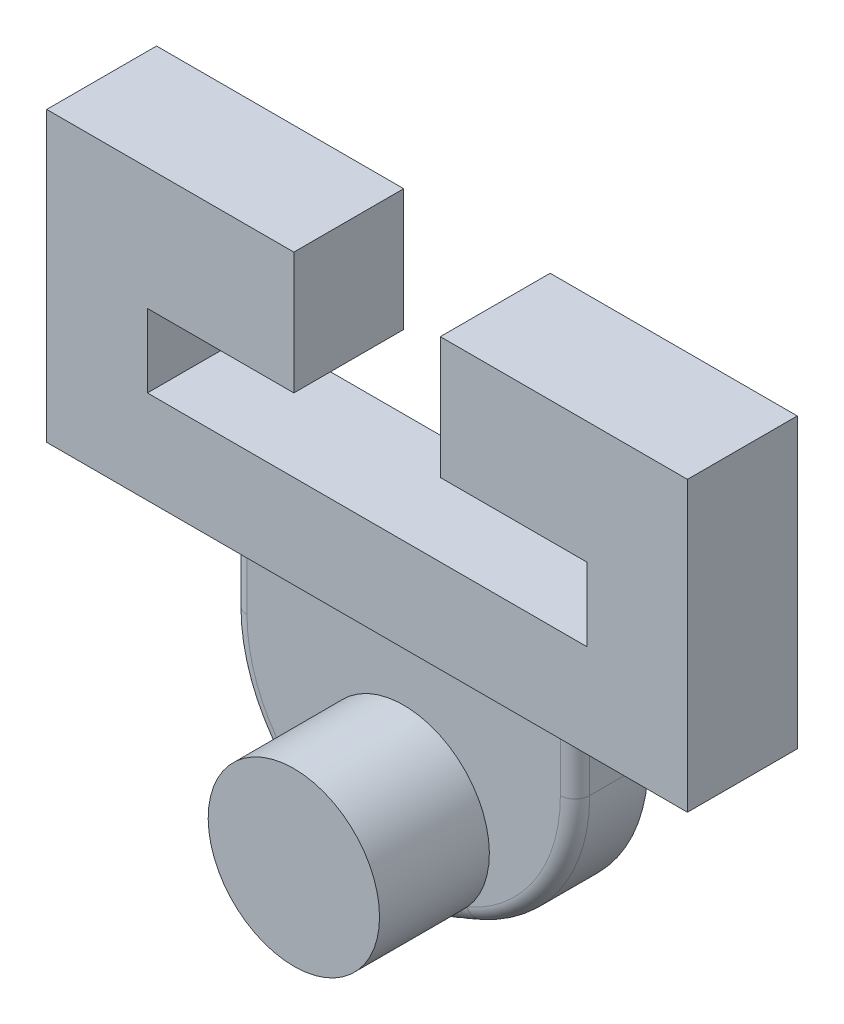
ISO-10303-21;
HEADER;
FILE_DESCRIPTION(('STEP AP214'),'2;1');
FILE_NAME('part.step','',(''),(''),'','','');
FILE_SCHEMA(('AUTOMOTIVE_DESIGN { 1 0 10303 214 1 1 1 1 }'));
ENDSEC;
DATA;
#1=APPLICATION_CONTEXT('core data for automotive mechanical design processes');
#2=APPLICATION_PROTOCOL_DEFINITION('international standard','automotive_design',2000,#1);
#3=PRODUCT_CONTEXT('',#1,'mechanical');
#4=PRODUCT('Part','Part','',(#3));
#5=PRODUCT_RELATED_PRODUCT_CATEGORY('part','',(#4));
#6=PRODUCT_DEFINITION_FORMATION('','',#4);
#7=PRODUCT_DEFINITION_CONTEXT('part definition',#1,'design');
#8=PRODUCT_DEFINITION('design','',#6,#7);
#9=PRODUCT_DEFINITION_SHAPE('','',#8);
#10=(LENGTH_UNIT() NAMED_UNIT(*) SI_UNIT(.MILLI.,.METRE.));
#11=(NAMED_UNIT(*) PLANE_ANGLE_UNIT() SI_UNIT($,.RADIAN.));
#12=(NAMED_UNIT(*) SI_UNIT($,.STERADIAN.) SOLID_ANGLE_UNIT());
#13=UNCERTAINTY_MEASURE_WITH_UNIT(LENGTH_MEASURE(1.E-05),#10,'distance_accuracy_value','');
#14=(GEOMETRIC_REPRESENTATION_CONTEXT(3) GLOBAL_UNCERTAINTY_ASSIGNED_CONTEXT((#13)) GLOBAL_UNIT_ASSIGNED_CONTEXT((#10,
#11,#12)) REPRESENTATION_CONTEXT('',''));
#15=CARTESIAN_POINT('',(0.,0.,0.));
#16=DIRECTION('',(0.,0.,1.));
#17=DIRECTION('',(1.,0.,0.));
#18=AXIS2_PLACEMENT_3D('',#15,#16,#17);
#19=CARTESIAN_POINT('',(-55.5625,60.7265647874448,19.05));
#20=DIRECTION('',(0.,-1.,0.));
#21=DIRECTION('',(0.,0.,-1.));
#22=AXIS2_PLACEMENT_3D('',#19,#20,#21);
#23=PLANE('',#22);
#24=DIRECTION('',(-1.,0.,0.));
#25=VECTOR('',#24,1.);
#26=CARTESIAN_POINT('',(-55.5625,60.7265647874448,19.05));
#27=LINE('',#26,#25);
#28=CARTESIAN_POINT('',(38.1,60.7265647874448,19.05));
#29=VERTEX_POINT('',#28);
#30=CARTESIAN_POINT('',(-38.1,60.7265647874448,19.05));
#31=VERTEX_POINT('',#30);
#32=EDGE_CURVE('E220',#29,#31,#27,.T.);
#33=ORIENTED_EDGE('',*,*,#32,.F.);
#34=DIRECTION('',(0.,0.,-1.));
#35=VECTOR('',#34,1.);
#36=CARTESIAN_POINT('',(38.1,60.7265647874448,19.05));
#37=LINE('',#36,#35);
#38=CARTESIAN_POINT('',(38.1,60.7265647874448,0.));
#39=VERTEX_POINT('',#38);
#40=EDGE_CURVE('E272',#29,#39,#37,.T.);
#41=ORIENTED_EDGE('',*,*,#40,.T.);
#42=DIRECTION('',(-1.,0.,0.));
#43=VECTOR('',#42,1.);
#44=CARTESIAN_POINT('',(-55.5625,60.7265647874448,0.));
#45=LINE('',#44,#43);
#46=CARTESIAN_POINT('',(-38.1,60.7265647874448,0.));
#47=VERTEX_POINT('',#46);
#48=EDGE_CURVE('E289',#39,#47,#45,.T.);
#49=ORIENTED_EDGE('',*,*,#48,.T.);
#50=DIRECTION('',(0.,0.,-1.));
#51=VECTOR('',#50,1.);
#52=CARTESIAN_POINT('',(-38.1,60.7265647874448,19.05));
#53=LINE('',#52,#51);
#54=EDGE_CURVE('E236',#31,#47,#53,.T.);
#55=ORIENTED_EDGE('',*,*,#54,.F.);
#56=EDGE_LOOP('',(#33,#41,#49,#55));
#57=FACE_BOUND('',#56,.T.);
#58=ADVANCED_FACE('F47',(#57),#23,.F.);
#59=CARTESIAN_POINT('',(0.,29.7164038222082,12.7));
#60=DIRECTION('',(0.,0.,-1.));
#61=DIRECTION('',(-1.,0.,0.));
#62=AXIS2_PLACEMENT_3D('',#59,#60,#61);
#63=CYLINDRICAL_SURFACE('',#62,29.7164038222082);
#64=CARTESIAN_POINT('',(-15.1252473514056,4.137280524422,10.5775264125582));
#65=CARTESIAN_POINT('',(-14.7594022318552,3.92095184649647,11.9670725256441));
#66=CARTESIAN_POINT('',(-13.9364084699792,4.88953395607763,12.6713516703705));
#67=CARTESIAN_POINT('',(-13.1134147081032,5.85811606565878,13.3756308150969));
#68=CARTESIAN_POINT('',(-12.6450056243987,7.05627927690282,12.7));
#69=CARTESIAN_POINT('',(-15.0129342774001,4.07086392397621,10.5410536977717));
#70=CARTESIAN_POINT('',(-14.6713586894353,3.87104192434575,11.9205983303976));
#71=CARTESIAN_POINT('',(-13.8735978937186,4.82827567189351,12.6324992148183));
#72=CARTESIAN_POINT('',(-13.0762371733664,5.78589265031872,13.3446372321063));
#73=CARTESIAN_POINT('',(-12.5943085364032,6.97410612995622,12.7));
#74=CARTESIAN_POINT('',(-14.8993439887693,4.00469931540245,10.5075949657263));
#75=CARTESIAN_POINT('',(-14.5799956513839,3.81976346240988,11.8761221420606));
#76=CARTESIAN_POINT('',(-13.8070809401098,4.76584547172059,12.5947683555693));
#77=CARTESIAN_POINT('',(-13.0345743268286,5.71229594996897,13.3136257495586));
#78=CARTESIAN_POINT('',(-12.5420804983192,6.89125496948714,12.7));
#79=CARTESIAN_POINT('',(-14.6700084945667,3.87316658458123,10.4461826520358));
#80=CARTESIAN_POINT('',(-14.3921204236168,3.71554708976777,11.7915011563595));
#81=CARTESIAN_POINT('',(-13.6675810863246,4.63936364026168,12.5217937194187));
#82=CARTESIAN_POINT('',(-12.9434395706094,5.56354242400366,13.2522966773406));
#83=CARTESIAN_POINT('',(-12.4346153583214,6.72454885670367,12.7));
#84=CARTESIAN_POINT('',(-14.5542642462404,3.80779812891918,10.4182266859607));
#85=CARTESIAN_POINT('',(-14.2956114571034,3.66260357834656,11.7513167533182));
#86=CARTESIAN_POINT('',(-13.5946010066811,4.57531272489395,12.4865488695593));
#87=CARTESIAN_POINT('',(-12.8940020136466,5.48837261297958,13.2219654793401));
#88=CARTESIAN_POINT('',(-12.3793795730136,6.64069435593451,12.7));
#89=CARTESIAN_POINT('',(-14.3211642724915,3.67822662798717,10.367319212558));
#90=CARTESIAN_POINT('',(-14.0984979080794,3.55586475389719,11.6753011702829));
#91=CARTESIAN_POINT('',(-13.4432227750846,4.44639134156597,12.4188263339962));
#92=CARTESIAN_POINT('',(-12.7883574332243,5.33726660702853,13.1625344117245));
#93=CARTESIAN_POINT('',(-12.2660254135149,6.47243662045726,12.7));
#94=CARTESIAN_POINT('',(-14.2038123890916,3.61402144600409,10.3443574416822));
#95=CARTESIAN_POINT('',(-13.9978986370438,3.50206214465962,11.6394278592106));
#96=CARTESIAN_POINT('',(-13.3648361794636,4.38152284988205,12.386343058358));
#97=CARTESIAN_POINT('',(-12.7321873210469,5.26131681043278,13.1334177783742));
#98=CARTESIAN_POINT('',(-12.2079132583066,6.38803488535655,12.7));
#99=CARTESIAN_POINT('',(-13.9675073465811,3.48681347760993,10.3029458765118));
#100=CARTESIAN_POINT('',(-13.7930446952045,3.39400309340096,11.5717892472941));
#101=CARTESIAN_POINT('',(-13.2031676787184,4.25132072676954,12.3241136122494));
#102=CARTESIAN_POINT('',(-12.6137025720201,5.10896994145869,13.0765962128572));
#103=CARTESIAN_POINT('',(-12.0887051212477,6.21875200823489,12.7));
#104=CARTESIAN_POINT('',(-13.8485539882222,3.42381084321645,10.2844966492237));
#105=CARTESIAN_POINT('',(-13.6887814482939,3.33973482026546,11.5399947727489));
#106=CARTESIAN_POINT('',(-13.1198851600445,4.18598703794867,12.2943677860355));
#107=CARTESIAN_POINT('',(-12.5514029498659,5.0325552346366,13.0488768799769));
#108=CARTESIAN_POINT('',(-12.0276087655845,6.13387080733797,12.7));
#109=CARTESIAN_POINT('',(-13.4916742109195,3.23790573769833,10.23564383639));
#110=CARTESIAN_POINT('',(-13.3738671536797,3.17820400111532,11.4512563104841));
#111=CARTESIAN_POINT('',(-12.8650118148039,3.99103555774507,12.2097366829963));
#112=CARTESIAN_POINT('',(-12.3577655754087,4.80509937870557,12.968754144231));
#113=CARTESIAN_POINT('',(-11.8409159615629,5.88030397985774,12.7));
#114=CARTESIAN_POINT('',(-13.2517006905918,3.11697826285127,10.2113079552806));
#115=CARTESIAN_POINT('',(-13.1578130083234,3.07043575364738,11.3997330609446));
#116=CARTESIAN_POINT('',(-12.6870627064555,3.86133543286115,12.1588708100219));
#117=CARTESIAN_POINT('',(-12.2178986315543,4.65334068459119,12.9184035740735));
#118=CARTESIAN_POINT('',(-11.7109333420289,5.71122951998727,12.7));
#119=CARTESIAN_POINT('',(-12.7674752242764,2.88118603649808,10.1766489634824));
#120=CARTESIAN_POINT('',(-12.7163181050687,2.85709419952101,11.3108590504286));
#121=CARTESIAN_POINT('',(-12.3172582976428,3.60397110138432,12.0674948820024));
#122=CARTESIAN_POINT('',(-11.9197803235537,4.35194724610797,12.8245185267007));
#123=CARTESIAN_POINT('',(-11.4391100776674,5.37347695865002,12.7));
#124=CARTESIAN_POINT('',(-12.5232201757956,2.76632594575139,10.1663364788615));
#125=CARTESIAN_POINT('',(-12.4907707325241,2.7514172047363,11.2733623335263));
#126=CARTESIAN_POINT('',(-12.1253925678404,3.47630851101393,12.0269926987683));
#127=CARTESIAN_POINT('',(-11.7615503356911,4.20217359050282,12.7808930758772));
#128=CARTESIAN_POINT('',(-11.2972605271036,5.20479925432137,12.7));
#129=CARTESIAN_POINT('',(-11.8421245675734,2.45733541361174,10.154752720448));
#130=CARTESIAN_POINT('',(-11.8578174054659,2.46478245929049,11.1875137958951));
#131=CARTESIAN_POINT('',(-11.5778967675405,3.12779472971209,11.9282875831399));
#132=CARTESIAN_POINT('',(-11.3027154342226,3.79383074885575,12.6699278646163));
#133=CARTESIAN_POINT('',(-10.8878151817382,4.73999479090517,12.7));
#134=CARTESIAN_POINT('',(-11.4017740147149,2.27024715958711,10.1665522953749));
#135=CARTESIAN_POINT('',(-11.4402993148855,2.28655758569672,11.152065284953));
#136=CARTESIAN_POINT('',(-11.2098981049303,2.91085807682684,11.8804595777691));
#137=CARTESIAN_POINT('',(-10.9838821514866,3.53755298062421,12.6092577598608));
#138=CARTESIAN_POINT('',(-10.6074782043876,4.4457139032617,12.7));
#139=CARTESIAN_POINT('',(-10.5146364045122,1.91828857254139,10.2211772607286));
#140=CARTESIAN_POINT('',(-10.5902504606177,1.94727107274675,11.1148566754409));
#141=CARTESIAN_POINT('',(-10.4462372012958,2.49436085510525,11.8114199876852));
#142=CARTESIAN_POINT('',(-10.3065749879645,3.04382099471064,12.5083693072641));
#143=CARTESIAN_POINT('',(-10.0092308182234,3.86938235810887,12.7));
#144=CARTESIAN_POINT('',(-10.0678469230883,1.75342686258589,10.2640146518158));
#145=CARTESIAN_POINT('',(-10.1571240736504,1.78571844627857,11.1126948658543));
#146=CARTESIAN_POINT('',(-10.0505643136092,2.29480704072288,11.7902187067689));
#147=CARTESIAN_POINT('',(-9.94792924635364,2.80571957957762,12.4678370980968));
#148=CARTESIAN_POINT('',(-9.69130591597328,3.58733647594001,12.7));
#149=CARTESIAN_POINT('',(-9.1675218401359,1.44541220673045,10.3755351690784));
#150=CARTESIAN_POINT('',(-9.27775449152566,1.48138191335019,11.1364643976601));
#151=CARTESIAN_POINT('',(-9.23466534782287,1.91551271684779,11.7706306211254));
#152=CARTESIAN_POINT('',(-9.1955084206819,2.35147208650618,12.4048909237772));
#153=CARTESIAN_POINT('',(-9.01627012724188,3.04029819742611,12.7));
#154=CARTESIAN_POINT('',(-8.71396143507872,1.30240334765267,10.4443802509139));
#155=CARTESIAN_POINT('',(-8.83083191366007,1.33828579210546,11.1623223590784));
#156=CARTESIAN_POINT('',(-8.81429964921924,1.73590568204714,11.7723891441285));
#157=CARTESIAN_POINT('',(-8.80123110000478,2.13488004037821,12.3823652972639));
#158=CARTESIAN_POINT('',(-8.65892383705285,2.77542510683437,12.7));
#159=CARTESIAN_POINT('',(-7.80477259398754,1.03933625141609,10.603185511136));
#160=CARTESIAN_POINT('',(-7.9298783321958,1.07348378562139,11.2374374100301));
#161=CARTESIAN_POINT('',(-7.95582222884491,1.40061607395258,11.7955059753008));
#162=CARTESIAN_POINT('',(-7.98520413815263,1.7290894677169,12.3534793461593));
#163=CARTESIAN_POINT('',(-7.90838397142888,2.27138268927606,12.7));
#164=CARTESIAN_POINT('',(-7.34914438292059,0.919275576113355,10.6931434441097));
#165=CARTESIAN_POINT('',(-7.47526618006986,0.951417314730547,11.2865586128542));
#166=CARTESIAN_POINT('',(-7.51771239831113,1.24493095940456,11.8168621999));
#167=CARTESIAN_POINT('',(-7.56309814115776,1.53938189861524,12.3469678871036));
#168=CARTESIAN_POINT('',(-7.51519421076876,2.03221063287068,12.7));
#169=CARTESIAN_POINT('',(-6.32093380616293,0.674083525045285,10.9151422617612));
#170=CARTESIAN_POINT('',(-6.44583076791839,0.701294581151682,11.4185624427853));
#171=CARTESIAN_POINT('',(-6.51404818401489,0.923054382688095,11.8832725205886));
#172=CARTESIAN_POINT('',(-6.5868456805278,1.14628976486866,12.347683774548));
#173=CARTESIAN_POINT('',(-6.59150290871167,1.52927697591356,12.7));
#174=CARTESIAN_POINT('',(-5.74807246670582,0.555425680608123,11.0520674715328));
#175=CARTESIAN_POINT('',(-5.86773113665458,0.578831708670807,11.50691413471));
#176=CARTESIAN_POINT('',(-5.94441462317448,0.764257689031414,11.9329716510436));
#177=CARTESIAN_POINT('',(-6.02462768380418,0.950522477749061,12.3586712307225));
#178=CARTESIAN_POINT('',(-6.05150870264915,1.27472718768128,12.7));
#179=CARTESIAN_POINT('',(-4.60216091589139,0.352760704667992,11.3454740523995));
#180=CARTESIAN_POINT('',(-4.70741182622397,0.369144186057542,11.7054395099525));
#181=CARTESIAN_POINT('',(-4.7888927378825,0.490002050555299,12.0514112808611));
#182=CARTESIAN_POINT('',(-4.8738868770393,0.611692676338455,12.3970191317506));
#183=CARTESIAN_POINT('',(-4.92807836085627,0.828032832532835,12.7));
#184=CARTESIAN_POINT('',(-4.02911069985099,0.268764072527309,11.501961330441));
#185=CARTESIAN_POINT('',(-4.12404059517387,0.281504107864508,11.8156885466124));
#186=CARTESIAN_POINT('',(-4.20299954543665,0.374556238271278,12.1201575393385));
#187=CARTESIAN_POINT('',(-4.28435004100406,0.467983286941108,12.4243240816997));
#188=CARTESIAN_POINT('',(-4.3446291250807,0.635907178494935,12.7));
#189=CARTESIAN_POINT('',(-2.88494855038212,0.134776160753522,11.8273180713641));
#190=CARTESIAN_POINT('',(-2.95708220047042,0.141610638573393,12.0501217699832));
#191=CARTESIAN_POINT('',(-3.02220414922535,0.189124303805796,12.2701422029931));
#192=CARTESIAN_POINT('',(-3.08969727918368,0.2370109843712,12.4898601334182));
#193=CARTESIAN_POINT('',(-3.14808464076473,0.32421212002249,12.7));
#194=CARTESIAN_POINT('',(-2.31383540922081,0.0846984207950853,11.9961548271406));
#195=CARTESIAN_POINT('',(-2.37235301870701,0.0889881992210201,12.1744443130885));
#196=CARTESIAN_POINT('',(-2.42732883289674,0.119022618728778,12.3513481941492));
#197=CARTESIAN_POINT('',(-2.48351291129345,0.149151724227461,12.5280838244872));
#198=CARTESIAN_POINT('',(-2.53506906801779,0.204458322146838,12.7));
#199=CARTESIAN_POINT('',(-1.17214637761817,0.0176233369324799,12.340137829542));
#200=CARTESIAN_POINT('',(-1.20293419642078,0.0185824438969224,12.4299947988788));
#201=CARTESIAN_POINT('',(-1.23251592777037,0.0249021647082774,12.5200989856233));
#202=CARTESIAN_POINT('',(-1.26330727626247,0.0313176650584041,12.6100299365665));
#203=CARTESIAN_POINT('',(-1.29281818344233,0.0431156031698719,12.7));
#204=CARTESIAN_POINT('',(-0.601570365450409,0.000613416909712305,12.5152816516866));
#205=CARTESIAN_POINT('',(-0.617086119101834,0.000645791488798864,12.5614593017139));
#206=CARTESIAN_POINT('',(-0.632580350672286,0.000865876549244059,12.6076413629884));
#207=CARTESIAN_POINT('',(-0.648096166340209,0.00108725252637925,12.6538203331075));
#208=CARTESIAN_POINT('',(-0.663589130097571,0.00149696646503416,12.7));
#209=CARTESIAN_POINT('',(-0.0207459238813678,5.43583067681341E-06,12.6936297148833));
#210=CARTESIAN_POINT('',(-0.021280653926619,5.70256168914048E-06,12.6952222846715));
#211=CARTESIAN_POINT('',(-0.0218153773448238,7.64648781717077E-06,12.6968148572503));
#212=CARTESIAN_POINT('',(-0.0223501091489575,9.56750377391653E-06,12.6984074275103));
#213=CARTESIAN_POINT('',(-0.0228848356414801,1.31539917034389E-05,12.7));
#214=CARTESIAN_POINT('',(-0.0103729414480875,4.76521030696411E-09,12.6968148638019));
#215=CARTESIAN_POINT('',(-0.0106403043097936,-8.9755584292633E-09,12.6976111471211));
#216=CARTESIAN_POINT('',(-0.0109076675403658,-1.17819235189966E-08,12.6984074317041));
#217=CARTESIAN_POINT('',(-0.0111750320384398,-3.83468723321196E-08,12.6992037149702));
#218=CARTESIAN_POINT('',(-0.01144239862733,-6.61285187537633E-08,12.7));
#219=CARTESIAN_POINT('',(0.,0.,12.7));
#220=CARTESIAN_POINT('',(0.,0.,12.7));
#221=CARTESIAN_POINT('',(0.,0.,12.7));
#222=CARTESIAN_POINT('',(0.,0.,12.7));
#223=CARTESIAN_POINT('',(5.569922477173E-13,0.,12.7));
#224=(BOUNDED_SURFACE() B_SPLINE_SURFACE(3,2,((#64,#65,#66,#67,#68),(#69,#70,#71,#72,#73),(#74,
#75,#76,#77,#78),(#79,#80,#81,#82,#83),(#84,#85,#86,#87,#88),(#89,#90,#91,#92,#93),(#94,#95,#96,
#97,#98),(#99,#100,#101,#102,#103),(#104,#105,#106,#107,#108),(#109,#110,#111,#112,#113),(#114,
#115,#116,#117,#118),(#119,#120,#121,#122,#123),(#124,#125,#126,#127,#128),(#129,#130,#131,#132,
#133),(#134,#135,#136,#137,#138),(#139,#140,#141,#142,#143),(#144,#145,#146,#147,#148),(#149,
#150,#151,#152,#153),(#154,#155,#156,#157,#158),(#159,#160,#161,#162,#163),(#164,#165,#166,#167,
#168),(#169,#170,#171,#172,#173),(#174,#175,#176,#177,#178),(#179,#180,#181,#182,#183),(#184,
#185,#186,#187,#188),(#189,#190,#191,#192,#193),(#194,#195,#196,#197,#198),(#199,#200,#201,#202,
#203),(#204,#205,#206,#207,#208),(#209,#210,#211,#212,#213),(#214,#215,#216,#217,#218),(#219,
#220,#221,#222,#223)),.UNSPECIFIED.,.F.,.F.,.F.) B_SPLINE_SURFACE_WITH_KNOTS((4,2,2,2,2,2,2,2,2,
2,2,2,2,2,2,4),(3,2,3),(0.,0.374245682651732,0.748328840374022,1.12163580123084,
1.49498964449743,2.2352205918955,2.97601212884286,4.28705988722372,5.59861482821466,
6.9184754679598,8.2381958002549,9.89349432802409,11.5492939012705,13.2008567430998,
14.8517913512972,14.8818117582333),(0.,0.5,1.),
.UNSPECIFIED.) GEOMETRIC_REPRESENTATION_ITEM() RATIONAL_B_SPLINE_SURFACE(((1.,0.867998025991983,
1.,0.867998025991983,1.),(1.,0.870669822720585,1.,0.870669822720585,1.),(1.,0.873268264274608,
1.,0.873268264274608,1.),(1.,0.878327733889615,1.,0.878327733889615,1.),(1.,0.880788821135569,
1.,0.880788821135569,1.),(1.,0.885580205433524,1.,0.885580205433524,1.),(1.,0.887910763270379,
1.,0.887910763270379,1.),(1.,0.892456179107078,1.,0.892456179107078,1.),(1.,0.894671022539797,
1.,0.894671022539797,1.),(1.,0.901117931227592,1.,0.901117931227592,1.),(1.,0.905193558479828,
1.,0.905193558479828,1.),(1.,0.912981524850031,1.,0.912981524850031,1.),(1.,0.916693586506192,
1.,0.916693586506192,1.),(1.,0.926531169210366,1.,0.926531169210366,1.),(1.,0.932314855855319,
1.,0.932314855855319,1.),(1.,0.943041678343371,1.,0.943041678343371,1.),(1.,0.947984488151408,
1.,0.947984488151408,1.),(1.,0.957157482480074,1.,0.957157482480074,1.),(1.,0.961382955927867,
1.,0.961382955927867,1.),(1.,0.969143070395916,1.,0.969143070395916,1.),(1.,0.972677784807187,
1.,0.972677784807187,1.),(1.,0.97990714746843,1.,0.97990714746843,1.),(1.,0.983413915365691,1.,
0.983413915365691,1.),(1.,0.989426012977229,1.,0.989426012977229,1.),(1.,0.991931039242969,1.,
0.991931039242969,1.),(1.,0.99594002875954,1.,0.99594002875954,1.),(1.,0.997446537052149,1.,
0.997446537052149,1.),(1.,0.999467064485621,1.,0.999467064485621,1.),(1.,0.99998146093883,1.,
0.99998146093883,1.),(1.,0.99999983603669,1.,0.99999983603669,1.),(1.,1.00000000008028,1.,
1.00000000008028,1.),(1.,1.,1.,1.,1.))) REPRESENTATION_ITEM('') SURFACE());
#225=CARTESIAN_POINT('',(-15.1252473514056,4.137280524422,10.5775264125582));
#226=CARTESIAN_POINT('',(-15.0129342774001,4.07086392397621,10.5410536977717));
#227=CARTESIAN_POINT('',(-14.8993439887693,4.00469931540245,10.5075949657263));
#228=CARTESIAN_POINT('',(-14.6700084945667,3.87316658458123,10.4461826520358));
#229=CARTESIAN_POINT('',(-14.5542642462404,3.80779812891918,10.4182266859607));
#230=CARTESIAN_POINT('',(-14.3211642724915,3.67822662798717,10.367319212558));
#231=CARTESIAN_POINT('',(-14.2038123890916,3.61402144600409,10.3443574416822));
#232=CARTESIAN_POINT('',(-13.9675073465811,3.48681347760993,10.3029458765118));
#233=CARTESIAN_POINT('',(-13.8485539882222,3.42381084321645,10.2844966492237));
#234=CARTESIAN_POINT('',(-13.4916742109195,3.23790573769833,10.23564383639));
#235=CARTESIAN_POINT('',(-13.2517006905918,3.11697826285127,10.2113079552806));
#236=CARTESIAN_POINT('',(-12.7674752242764,2.88118603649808,10.1766489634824));
#237=CARTESIAN_POINT('',(-12.5232201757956,2.76632594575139,10.1663364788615));
#238=CARTESIAN_POINT('',(-11.8421245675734,2.45733541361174,10.154752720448));
#239=CARTESIAN_POINT('',(-11.4017740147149,2.27024715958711,10.1665522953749));
#240=CARTESIAN_POINT('',(-10.5146364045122,1.91828857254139,10.2211772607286));
#241=CARTESIAN_POINT('',(-10.0678469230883,1.75342686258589,10.2640146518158));
#242=CARTESIAN_POINT('',(-9.1675218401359,1.44541220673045,10.3755351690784));
#243=CARTESIAN_POINT('',(-8.71396143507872,1.30240334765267,10.4443802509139));
#244=CARTESIAN_POINT('',(-7.80477259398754,1.03933625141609,10.603185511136));
#245=CARTESIAN_POINT('',(-7.34914438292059,0.919275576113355,10.6931434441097));
#246=CARTESIAN_POINT('',(-6.32093380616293,0.674083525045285,10.9151422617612));
#247=CARTESIAN_POINT('',(-5.74807246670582,0.555425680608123,11.0520674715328));
#248=CARTESIAN_POINT('',(-4.60216091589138,0.352760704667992,11.3454740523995));
#249=CARTESIAN_POINT('',(-4.02911069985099,0.268764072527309,11.501961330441));
#250=CARTESIAN_POINT('',(-2.88494855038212,0.134776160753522,11.8273180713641));
#251=CARTESIAN_POINT('',(-2.31383540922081,0.0846984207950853,11.9961548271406));
#252=CARTESIAN_POINT('',(-1.17214637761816,0.0176233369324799,12.340137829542));
#253=CARTESIAN_POINT('',(-0.601570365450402,0.000613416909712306,12.5152816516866));
#254=CARTESIAN_POINT('',(-0.0207459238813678,5.43583067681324E-06,12.6936297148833));
#255=CARTESIAN_POINT('',(-0.0103729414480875,4.76521030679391E-09,12.6968148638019));
#256=CARTESIAN_POINT('',(0.,0.,12.7));
#257=B_SPLINE_CURVE_WITH_KNOTS('',3,(#225,#226,#227,#228,#229,#230,#231,#232,#233,#234,#235,
#236,#237,#238,#239,#240,#241,#242,#243,#244,#245,#246,#247,#248,#249,#250,#251,#252,#253,#254,
#255,#256),.UNSPECIFIED.,.F.,.F.,(4,2,2,2,2,2,2,2,2,2,2,2,2,2,2,4),(0.,0.374245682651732,
0.748328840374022,1.12163580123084,1.49498964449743,2.2352205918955,2.97601212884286,
4.28705988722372,5.59861482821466,6.9184754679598,8.2381958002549,9.89349432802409,
11.5492939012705,13.2008567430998,14.8517913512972,14.8818117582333),.UNSPECIFIED.);
#258=CARTESIAN_POINT('',(0.,0.,12.7));
#259=VERTEX_POINT('',#258);
#260=CARTESIAN_POINT('',(-12.0211368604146,2.54,10.16));
#261=VERTEX_POINT('',#260);
#262=EDGE_CURVE('E68',#259,#261,#257,.F.);
#263=ORIENTED_EDGE('',*,*,#262,.T.);
#264=CARTESIAN_POINT('',(0.,29.7164038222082,10.16));
#265=DIRECTION('',(0.,0.,-1.));
#266=DIRECTION('',(-1.,0.,0.));
#267=AXIS2_PLACEMENT_3D('',#264,#265,#266);
#268=CIRCLE('',#267,29.7164038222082);
#269=CARTESIAN_POINT('',(-29.7164038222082,29.7164038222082,10.16));
#270=VERTEX_POINT('',#269);
#271=EDGE_CURVE('E563',#261,#270,#268,.T.);
#272=ORIENTED_EDGE('',*,*,#271,.T.);
#273=DIRECTION('',(0.,0.,-1.));
#274=VECTOR('',#273,1.);
#275=CARTESIAN_POINT('',(-29.7164038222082,29.7164038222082,12.7));
#276=LINE('',#275,#274);
#277=CARTESIAN_POINT('',(-29.7164038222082,29.7164038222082,0.));
#278=VERTEX_POINT('',#277);
#279=EDGE_CURVE('E323',#270,#278,#276,.T.);
#280=ORIENTED_EDGE('',*,*,#279,.T.);
#281=CARTESIAN_POINT('',(0.,29.7164038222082,0.));
#282=DIRECTION('',(0.,0.,1.));
#283=DIRECTION('',(-1.,0.,0.));
#284=AXIS2_PLACEMENT_3D('',#281,#282,#283);
#285=CIRCLE('',#284,29.7164038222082);
#286=CARTESIAN_POINT('',(29.7164038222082,29.7164038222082,0.));
#287=VERTEX_POINT('',#286);
#288=EDGE_CURVE('E310',#278,#287,#285,.T.);
#289=ORIENTED_EDGE('',*,*,#288,.T.);
#290=DIRECTION('',(0.,0.,-1.));
#291=VECTOR('',#290,1.);
#292=CARTESIAN_POINT('',(29.7164038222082,29.7164038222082,12.7));
#293=LINE('',#292,#291);
#294=CARTESIAN_POINT('',(29.7164038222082,29.7164038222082,10.16));
#295=VERTEX_POINT('',#294);
#296=EDGE_CURVE('E325',#295,#287,#293,.T.);
#297=ORIENTED_EDGE('',*,*,#296,.F.);
#298=CARTESIAN_POINT('',(0.,29.7164038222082,10.16));
#299=DIRECTION('',(0.,0.,-1.));
#300=DIRECTION('',(-1.,0.,0.));
#301=AXIS2_PLACEMENT_3D('',#298,#299,#300);
#302=CIRCLE('',#301,29.7164038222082);
#303=CARTESIAN_POINT('',(12.0211368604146,2.54000000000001,10.16));
#304=VERTEX_POINT('',#303);
#305=EDGE_CURVE('E74',#295,#304,#302,.T.);
#306=ORIENTED_EDGE('',*,*,#305,.T.);
#307=CARTESIAN_POINT('',(12.645005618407,7.05627926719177,12.7));
#308=CARTESIAN_POINT('',(13.1134147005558,5.85811605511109,13.3756308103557));
#309=CARTESIAN_POINT('',(13.9364084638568,4.88953394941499,12.6713516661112));
#310=CARTESIAN_POINT('',(14.7594022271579,3.9209518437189,11.9670725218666));
#311=CARTESIAN_POINT('',(15.1252473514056,4.137280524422,10.5775264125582));
#312=CARTESIAN_POINT('',(12.5943085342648,6.97410612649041,12.7));
#313=CARTESIAN_POINT('',(13.0762371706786,5.78589264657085,13.3446372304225));
#314=CARTESIAN_POINT('',(13.8735978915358,4.82827566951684,12.6324992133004));
#315=CARTESIAN_POINT('',(14.6713586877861,3.87104192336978,11.9205983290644));
#316=CARTESIAN_POINT('',(15.012934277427,4.07086392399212,10.541053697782));
#317=CARTESIAN_POINT('',(12.5420804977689,6.8912549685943,12.7));
#318=CARTESIAN_POINT('',(13.0345743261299,5.7122959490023,13.3136257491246));
#319=CARTESIAN_POINT('',(13.8070809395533,4.76584547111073,12.5947683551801));
#320=CARTESIAN_POINT('',(14.579995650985,3.81976346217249,11.8761221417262));
#321=CARTESIAN_POINT('',(14.899343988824,4.00469931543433,10.5075949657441));
#322=CARTESIAN_POINT('',(12.4346153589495,6.72454885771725,12.7));
#323=CARTESIAN_POINT('',(12.943439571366,5.56354242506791,13.2522966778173));
#324=CARTESIAN_POINT('',(13.667581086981,4.63936364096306,12.5217937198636));
#325=CARTESIAN_POINT('',(14.3921204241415,3.71554709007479,11.7915011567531));
#326=CARTESIAN_POINT('',(14.6700084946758,3.8731665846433,10.4461826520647));
#327=CARTESIAN_POINT('',(12.379379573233,6.64069435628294,12.7));
#328=CARTESIAN_POINT('',(12.8940020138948,5.48837261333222,13.2219654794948));
#329=CARTESIAN_POINT('',(13.5946010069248,4.57531272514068,12.4865488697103));
#330=CARTESIAN_POINT('',(14.2956114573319,3.66260357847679,11.751316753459));
#331=CARTESIAN_POINT('',(14.554264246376,3.8077981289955,10.4182266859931));
#332=CARTESIAN_POINT('',(12.2660254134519,6.47243662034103,12.7));
#333=CARTESIAN_POINT('',(12.7883574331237,5.33726660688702,13.1625344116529));
#334=CARTESIAN_POINT('',(13.4432227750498,4.44639134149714,12.4188263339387));
#335=CARTESIAN_POINT('',(14.098497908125,3.55586475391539,11.6753011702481));
#336=CARTESIAN_POINT('',(14.3211642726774,3.67822662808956,10.3673192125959));
#337=CARTESIAN_POINT('',(12.207913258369,6.388034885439,12.7));
#338=CARTESIAN_POINT('',(12.7321873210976,5.26131681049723,13.1334177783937));
#339=CARTESIAN_POINT('',(13.3648361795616,4.38152284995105,12.3863430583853));
#340=CARTESIAN_POINT('',(13.9978986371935,3.50206214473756,11.6394278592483));
#341=CARTESIAN_POINT('',(14.2038123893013,3.61402144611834,10.3443574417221));
#342=CARTESIAN_POINT('',(12.0887051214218,6.21875200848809,12.7));
#343=CARTESIAN_POINT('',(12.6137025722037,5.10896994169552,13.0765962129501));
#344=CARTESIAN_POINT('',(13.2031676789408,4.2513207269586,12.3241136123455));
#345=CARTESIAN_POINT('',(13.7930446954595,3.39400309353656,11.5717892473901));
#346=CARTESIAN_POINT('',(13.9675073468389,3.48681347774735,10.3029458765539));
#347=CARTESIAN_POINT('',(12.0276087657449,6.13387080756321,12.7));
#348=CARTESIAN_POINT('',(12.5514029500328,5.03255523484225,13.0488768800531));
#349=CARTESIAN_POINT('',(13.1198851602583,4.18598703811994,12.2943677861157));
#350=CARTESIAN_POINT('',(13.6887814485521,3.33973482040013,11.5399947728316));
#351=CARTESIAN_POINT('',(13.8485539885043,3.42381084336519,10.2844966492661));
#352=CARTESIAN_POINT('',(11.8409159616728,5.88030397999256,12.7));
#353=CARTESIAN_POINT('',(12.3577655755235,4.8050993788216,12.9687541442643));
#354=CARTESIAN_POINT('',(12.8650118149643,3.9910355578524,12.2097366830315));
#355=CARTESIAN_POINT('',(13.3738671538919,3.17820400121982,11.4512563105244));
#356=CARTESIAN_POINT('',(13.4916742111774,3.2379057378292,10.2356438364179));
#357=CARTESIAN_POINT('',(11.7109333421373,5.71122952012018,12.7));
#358=CARTESIAN_POINT('',(12.2178986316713,4.65334068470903,12.9184035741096));
#359=CARTESIAN_POINT('',(12.6870627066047,3.86133543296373,12.1588708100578));
#360=CARTESIAN_POINT('',(13.1578130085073,3.07043575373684,11.3997330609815));
#361=CARTESIAN_POINT('',(13.2517006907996,3.11697826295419,10.2113079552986));
#362=CARTESIAN_POINT('',(11.4391100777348,5.37347695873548,12.7));
#363=CARTESIAN_POINT('',(11.9197803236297,4.35194724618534,12.8245185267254));
#364=CARTESIAN_POINT('',(12.3172582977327,3.60397110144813,12.0674948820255));
#365=CARTESIAN_POINT('',(12.7163181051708,2.85709419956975,11.3108590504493));
#366=CARTESIAN_POINT('',(12.7674752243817,2.88118603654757,10.1766489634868));
#367=CARTESIAN_POINT('',(11.2972605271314,5.20479925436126,12.7));
#368=CARTESIAN_POINT('',(11.7615503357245,4.20217359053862,12.7808930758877));
#369=CARTESIAN_POINT('',(12.1253925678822,3.4763085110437,12.0269926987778));
#370=CARTESIAN_POINT('',(12.4907707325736,2.75141720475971,11.2733623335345));
#371=CARTESIAN_POINT('',(12.5232201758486,2.76632594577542,10.1663364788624));
#372=CARTESIAN_POINT('',(10.8878151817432,4.73999479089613,12.7));
#373=CARTESIAN_POINT('',(11.302715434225,3.79383074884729,12.6699278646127));
#374=CARTESIAN_POINT('',(11.57789676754,3.12779472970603,11.9282875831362));
#375=CARTESIAN_POINT('',(11.8578174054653,2.46478245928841,11.1875137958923));
#376=CARTESIAN_POINT('',(11.842124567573,2.45733541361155,10.1547527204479));
#377=CARTESIAN_POINT('',(10.6074782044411,4.44571390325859,12.7));
#378=CARTESIAN_POINT('',(10.983882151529,3.53755298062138,12.6092577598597));
#379=CARTESIAN_POINT('',(11.2098981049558,2.91085807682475,11.880459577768));
#380=CARTESIAN_POINT('',(11.4402993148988,2.28655758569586,11.1520652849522));
#381=CARTESIAN_POINT('',(11.4017740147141,2.27024715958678,10.1665522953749));
#382=CARTESIAN_POINT('',(10.0092308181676,3.86938235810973,12.7));
#383=CARTESIAN_POINT('',(10.30657498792,3.04382099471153,12.5083693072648));
#384=CARTESIAN_POINT('',(10.4462372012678,2.49436085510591,11.811419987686));
#385=CARTESIAN_POINT('',(10.5902504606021,1.94727107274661,11.1148566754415));
#386=CARTESIAN_POINT('',(10.5146364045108,1.91828857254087,10.2211772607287));
#387=CARTESIAN_POINT('',(9.69130591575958,3.58733647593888,12.7));
#388=CARTESIAN_POINT('',(9.94792924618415,2.80571957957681,12.4678370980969));
#389=CARTESIAN_POINT('',(10.0505643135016,2.29480704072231,11.7902187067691));
#390=CARTESIAN_POINT('',(10.1571240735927,1.78571844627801,11.1126948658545));
#391=CARTESIAN_POINT('',(10.0678469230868,1.75342686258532,10.264014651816));
#392=CARTESIAN_POINT('',(9.0162701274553,3.04029819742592,12.7));
#393=CARTESIAN_POINT('',(9.1955084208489,2.35147208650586,12.4048909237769));
#394=CARTESIAN_POINT('',(9.23466534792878,1.91551271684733,11.7706306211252));
#395=CARTESIAN_POINT('',(9.2777544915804,1.48138191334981,11.13646439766));
#396=CARTESIAN_POINT('',(9.16752184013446,1.44541220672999,10.3755351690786));
#397=CARTESIAN_POINT('',(8.658923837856,2.7754251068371,12.7));
#398=CARTESIAN_POINT('',(8.80123110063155,2.13488004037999,12.382365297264));
#399=CARTESIAN_POINT('',(8.81429964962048,1.735905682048,11.7723891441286));
#400=CARTESIAN_POINT('',(8.83083191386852,1.33828579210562,11.1623223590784));
#401=CARTESIAN_POINT('',(8.71396143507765,1.30240334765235,10.444380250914));
#402=CARTESIAN_POINT('',(7.90838397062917,2.27138268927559,12.7));
#403=CARTESIAN_POINT('',(7.98520413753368,1.72908946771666,12.3534793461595));
#404=CARTESIAN_POINT('',(7.95582222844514,1.40061607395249,11.7955059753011));
#405=CARTESIAN_POINT('',(7.92987833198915,1.07348378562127,11.2374374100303));
#406=CARTESIAN_POINT('',(7.80477259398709,1.03933625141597,10.6031855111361));
#407=CARTESIAN_POINT('',(7.51519420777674,2.03221063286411,12.7));
#408=CARTESIAN_POINT('',(7.56309813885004,1.53938189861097,12.3469678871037));
#409=CARTESIAN_POINT('',(7.51771239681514,1.24493095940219,11.8168621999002));
#410=CARTESIAN_POINT('',(7.47526617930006,0.951417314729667,11.2865586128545));
#411=CARTESIAN_POINT('',(7.34914438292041,0.919275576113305,10.6931434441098));
#412=CARTESIAN_POINT('',(6.59150291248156,1.5292769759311,12.7));
#413=CARTESIAN_POINT('',(6.58684568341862,1.1462897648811,12.3476837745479));
#414=CARTESIAN_POINT('',(6.51404818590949,0.923054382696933,11.8832725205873));
#415=CARTESIAN_POINT('',(6.44583076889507,0.701294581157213,11.4185624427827));
#416=CARTESIAN_POINT('',(6.32093380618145,0.674083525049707,10.9151422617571));
#417=CARTESIAN_POINT('',(6.05150871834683,1.27472718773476,12.7));
#418=CARTESIAN_POINT('',(6.02462769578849,0.950522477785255,12.3586712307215));
#419=CARTESIAN_POINT('',(5.9444146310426,0.764257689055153,11.9329716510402));
#420=CARTESIAN_POINT('',(5.86773114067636,0.578831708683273,11.5069141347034));
#421=CARTESIAN_POINT('',(5.7480724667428,0.55542568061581,11.0520674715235));
#422=CARTESIAN_POINT('',(4.9280783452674,0.828032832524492,12.7));
#423=CARTESIAN_POINT('',(4.87388686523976,0.611692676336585,12.3970191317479));
#424=CARTESIAN_POINT('',(4.78889273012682,0.490002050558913,12.0514112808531));
#425=CARTESIAN_POINT('',(4.70741182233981,0.369144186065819,11.7054395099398));
#426=CARTESIAN_POINT('',(4.60216091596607,0.352760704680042,11.3454740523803));
#427=CARTESIAN_POINT('',(4.34462906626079,0.635907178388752,12.7));
#428=CARTESIAN_POINT('',(4.28434999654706,0.467983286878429,12.424324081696));
#429=CARTESIAN_POINT('',(4.20299951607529,0.374556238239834,12.1201575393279));
#430=CARTESIAN_POINT('',(4.12404058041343,0.2815041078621,11.8156885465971));
#431=CARTESIAN_POINT('',(4.02911069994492,0.268764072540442,11.5019613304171));
#432=CARTESIAN_POINT('',(3.14808469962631,0.324212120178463,12.7));
#433=CARTESIAN_POINT('',(3.08969732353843,0.23701098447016,12.4898601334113));
#434=CARTESIAN_POINT('',(3.02220417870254,0.189124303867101,12.2701422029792));
#435=CARTESIAN_POINT('',(2.95708221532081,0.1416106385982,12.0501217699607));
#436=CARTESIAN_POINT('',(2.88494855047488,0.134776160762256,11.827318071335));
#437=CARTESIAN_POINT('',(2.5350692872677,0.204458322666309,12.7));
#438=CARTESIAN_POINT('',(2.48351307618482,0.149151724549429,12.5280838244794));
#439=CARTESIAN_POINT('',(2.42732894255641,0.119022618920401,12.3513481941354));
#440=CARTESIAN_POINT('',(2.37235307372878,0.0889881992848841,12.1744443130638));
#441=CARTESIAN_POINT('',(2.31383540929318,0.0846984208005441,11.996154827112));
#442=CARTESIAN_POINT('',(1.29281796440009,0.0431156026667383,12.7));
#443=CARTESIAN_POINT('',(1.26330711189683,0.0313176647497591,12.6100299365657));
#444=CARTESIAN_POINT('',(1.23251581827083,0.024902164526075,12.5200989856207));
#445=CARTESIAN_POINT('',(1.20293414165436,0.0185824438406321,12.4299947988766));
#446=CARTESIAN_POINT('',(1.17214637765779,0.0176233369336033,12.3401378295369));
#447=CARTESIAN_POINT('',(0.663588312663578,0.00149696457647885,12.7));
#448=CARTESIAN_POINT('',(0.648095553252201,0.00108725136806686,12.6538203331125));
#449=CARTESIAN_POINT('',(0.632579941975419,0.000865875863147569,12.6076413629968));
#450=CARTESIAN_POINT('',(0.617085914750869,0.00064579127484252,12.5614593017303));
#451=CARTESIAN_POINT('',(0.601570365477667,0.00061341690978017,12.5152816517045));
#452=CARTESIAN_POINT('',(0.0228848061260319,1.31539235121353E-05,12.7));
#453=CARTESIAN_POINT('',(0.022350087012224,9.56746195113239E-06,12.6984074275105));
#454=CARTESIAN_POINT('',(0.0218153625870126,7.64646304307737E-06,12.6968148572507));
#455=CARTESIAN_POINT('',(0.0212806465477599,5.70255396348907E-06,12.6952222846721));
#456=CARTESIAN_POINT('',(0.0207459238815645,5.4358306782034E-06,12.6936297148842));
#457=CARTESIAN_POINT('',(0.011442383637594,-6.61631506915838E-08,12.7));
#458=CARTESIAN_POINT('',(0.0111750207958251,-3.83681128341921E-08,12.6992037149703));
#459=CARTESIAN_POINT('',(0.0109076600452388,-1.1794505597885E-08,12.6984074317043));
#460=CARTESIAN_POINT('',(0.010640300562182,-8.97948219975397E-09,12.6976111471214));
#461=CARTESIAN_POINT('',(0.0103729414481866,4.76521082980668E-09,12.6968148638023));
#462=CARTESIAN_POINT('',(-3.13992215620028E-13,0.,12.7));
#463=CARTESIAN_POINT('',(-3.13992215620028E-13,0.,12.7));
#464=CARTESIAN_POINT('',(-3.13992215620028E-13,0.,12.7));
#465=CARTESIAN_POINT('',(-3.13992215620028E-13,0.,12.7));
#466=CARTESIAN_POINT('',(0.,0.,12.7));
#467=(BOUNDED_SURFACE() B_SPLINE_SURFACE(3,2,((#307,#308,#309,#310,#311),(#312,#313,#314,#315,
#316),(#317,#318,#319,#320,#321),(#322,#323,#324,#325,#326),(#327,#328,#329,#330,#331),(#332,
#333,#334,#335,#336),(#337,#338,#339,#340,#341),(#342,#343,#344,#345,#346),(#347,#348,#349,#350,
#351),(#352,#353,#354,#355,#356),(#357,#358,#359,#360,#361),(#362,#363,#364,#365,#366),(#367,
#368,#369,#370,#371),(#372,#373,#374,#375,#376),(#377,#378,#379,#380,#381),(#382,#383,#384,#385,
#386),(#387,#388,#389,#390,#391),(#392,#393,#394,#395,#396),(#397,#398,#399,#400,#401),(#402,
#403,#404,#405,#406),(#407,#408,#409,#410,#411),(#412,#413,#414,#415,#416),(#417,#418,#419,#420,
#421),(#422,#423,#424,#425,#426),(#427,#428,#429,#430,#431),(#432,#433,#434,#435,#436),(#437,
#438,#439,#440,#441),(#442,#443,#444,#445,#446),(#447,#448,#449,#450,#451),(#452,#453,#454,#455,
#456),(#457,#458,#459,#460,#461),(#462,#463,#464,#465,#466)),.UNSPECIFIED.,.F.,.F.,
.F.) B_SPLINE_SURFACE_WITH_KNOTS((4,2,2,2,2,2,2,2,2,2,2,2,2,2,2,4),(3,2,3),(0.,
0.374245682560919,0.748328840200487,1.1216358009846,1.49498964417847,2.23522059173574,
2.97601212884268,4.28705988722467,5.59861482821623,6.91847546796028,8.2381958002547,
9.89349432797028,11.5492939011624,13.2008567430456,14.8517913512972,14.8818117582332),(0.,0.5,
1.),.UNSPECIFIED.) GEOMETRIC_REPRESENTATION_ITEM() RATIONAL_B_SPLINE_SURFACE(((1.,
0.867998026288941,1.,0.867998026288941,1.),(1.,0.870669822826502,1.,0.870669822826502,1.),(1.,
0.873268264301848,1.,0.873268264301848,1.),(1.,0.878327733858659,1.,0.878327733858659,1.),(1.,
0.880788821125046,1.,0.880788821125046,1.),(1.,0.885580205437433,1.,0.885580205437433,1.),(1.,
0.887910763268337,1.,0.887910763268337,1.),(1.,0.892456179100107,1.,0.892456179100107,1.),(1.,
0.89467102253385,1.,0.89467102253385,1.),(1.,0.901117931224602,1.,0.901117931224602,1.),(1.,
0.905193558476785,1.,0.905193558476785,1.),(1.,0.912981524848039,1.,0.912981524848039,1.),(1.,
0.916693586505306,1.,0.916693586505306,1.),(1.,0.92653116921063,1.,0.92653116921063,1.),(1.,
0.932314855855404,1.,0.932314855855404,1.),(1.,0.943041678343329,1.,0.943041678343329,1.),(1.,
0.947984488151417,1.,0.947984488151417,1.),(1.,0.957157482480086,1.,0.957157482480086,1.),(1.,
0.96138295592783,1.,0.96138295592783,1.),(1.,0.969143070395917,1.,0.969143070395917,1.),(1.,
0.972677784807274,1.,0.972677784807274,1.),(1.,0.979907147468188,1.,0.979907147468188,1.),(1.,
0.983413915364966,1.,0.983413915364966,1.),(1.,0.989426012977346,1.,0.989426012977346,1.),(1.,
0.99193103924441,1.,0.99193103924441,1.),(1.,0.995940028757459,1.,0.995940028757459,1.),(1.,
0.997446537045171,1.,0.997446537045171,1.),(1.,0.999467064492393,1.,0.999467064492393,1.),(1.,
0.99998146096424,1.,0.99998146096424,1.),(1.,0.999999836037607,1.,0.999999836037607,1.),(1.,
1.00000000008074,1.,1.00000000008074,1.),(1.,1.,1.,1.,1.))) REPRESENTATION_ITEM('') SURFACE());
#468=CARTESIAN_POINT('',(15.1252473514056,4.137280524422,10.5775264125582));
#469=CARTESIAN_POINT('',(15.012934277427,4.07086392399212,10.541053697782));
#470=CARTESIAN_POINT('',(14.899343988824,4.00469931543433,10.5075949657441));
#471=CARTESIAN_POINT('',(14.6700084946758,3.8731665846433,10.4461826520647));
#472=CARTESIAN_POINT('',(14.554264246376,3.8077981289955,10.4182266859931));
#473=CARTESIAN_POINT('',(14.3211642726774,3.67822662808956,10.3673192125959));
#474=CARTESIAN_POINT('',(14.2038123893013,3.61402144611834,10.3443574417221));
#475=CARTESIAN_POINT('',(13.9675073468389,3.48681347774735,10.3029458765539));
#476=CARTESIAN_POINT('',(13.8485539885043,3.42381084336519,10.2844966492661));
#477=CARTESIAN_POINT('',(13.4916742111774,3.2379057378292,10.2356438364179));
#478=CARTESIAN_POINT('',(13.2517006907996,3.11697826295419,10.2113079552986));
#479=CARTESIAN_POINT('',(12.7674752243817,2.88118603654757,10.1766489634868));
#480=CARTESIAN_POINT('',(12.5232201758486,2.76632594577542,10.1663364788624));
#481=CARTESIAN_POINT('',(11.842124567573,2.45733541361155,10.1547527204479));
#482=CARTESIAN_POINT('',(11.4017740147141,2.27024715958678,10.1665522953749));
#483=CARTESIAN_POINT('',(10.5146364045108,1.91828857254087,10.2211772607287));
#484=CARTESIAN_POINT('',(10.0678469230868,1.75342686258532,10.264014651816));
#485=CARTESIAN_POINT('',(9.16752184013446,1.44541220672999,10.3755351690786));
#486=CARTESIAN_POINT('',(8.71396143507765,1.30240334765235,10.444380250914));
#487=CARTESIAN_POINT('',(7.80477259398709,1.03933625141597,10.6031855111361));
#488=CARTESIAN_POINT('',(7.34914438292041,0.919275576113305,10.6931434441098));
#489=CARTESIAN_POINT('',(6.32093380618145,0.674083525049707,10.9151422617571));
#490=CARTESIAN_POINT('',(5.74807246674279,0.55542568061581,11.0520674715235));
#491=CARTESIAN_POINT('',(4.60216091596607,0.352760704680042,11.3454740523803));
#492=CARTESIAN_POINT('',(4.02911069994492,0.268764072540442,11.5019613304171));
#493=CARTESIAN_POINT('',(2.88494855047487,0.134776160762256,11.827318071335));
#494=CARTESIAN_POINT('',(2.31383540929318,0.0846984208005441,11.996154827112));
#495=CARTESIAN_POINT('',(1.1721463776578,0.0176233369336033,12.3401378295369));
#496=CARTESIAN_POINT('',(0.601570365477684,0.000613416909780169,12.5152816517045));
#497=CARTESIAN_POINT('',(0.0207459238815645,5.43583067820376E-06,12.6936297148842));
#498=CARTESIAN_POINT('',(0.0103729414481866,4.76521083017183E-09,12.6968148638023));
#499=CARTESIAN_POINT('',(0.,0.,12.7));
#500=B_SPLINE_CURVE_WITH_KNOTS('',3,(#468,#469,#470,#471,#472,#473,#474,#475,#476,#477,#478,
#479,#480,#481,#482,#483,#484,#485,#486,#487,#488,#489,#490,#491,#492,#493,#494,#495,#496,#497,
#498,#499),.UNSPECIFIED.,.F.,.F.,(4,2,2,2,2,2,2,2,2,2,2,2,2,2,2,4),(0.,0.374245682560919,
0.748328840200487,1.1216358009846,1.49498964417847,2.23522059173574,2.97601212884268,
4.28705988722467,5.59861482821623,6.91847546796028,8.2381958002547,9.89349432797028,
11.5492939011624,13.2008567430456,14.8517913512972,14.8818117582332),.UNSPECIFIED.);
#501=EDGE_CURVE('E358',#304,#259,#500,.T.);
#502=ORIENTED_EDGE('',*,*,#501,.T.);
#503=EDGE_LOOP('',(#263,#272,#280,#289,#297,#306,#502));
#504=FACE_BOUND('',#503,.T.);
#505=ADVANCED_FACE('F367',(#504),#63,.T.);
#506=CARTESIAN_POINT('',(29.7164038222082,29.7164038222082,12.7));
#507=DIRECTION('',(-1.,0.,0.));
#508=DIRECTION('',(0.,0.,1.));
#509=AXIS2_PLACEMENT_3D('',#506,#507,#508);
#510=PLANE('',#509);
#511=DIRECTION('',(0.,1.,0.));
#512=VECTOR('',#511,1.);
#513=CARTESIAN_POINT('',(29.7164038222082,29.7164038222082,0.));
#514=LINE('',#513,#512);
#515=CARTESIAN_POINT('',(29.7164038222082,42.0346057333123,0.));
#516=VERTEX_POINT('',#515);
#517=EDGE_CURVE('E317',#287,#516,#514,.T.);
#518=ORIENTED_EDGE('',*,*,#517,.T.);
#519=DIRECTION('',(0.,0.,-1.));
#520=VECTOR('',#519,1.);
#521=CARTESIAN_POINT('',(29.7164038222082,42.0346057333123,12.7));
#522=LINE('',#521,#520);
#523=CARTESIAN_POINT('',(29.7164038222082,42.0346057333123,10.16));
#524=VERTEX_POINT('',#523);
#525=EDGE_CURVE('E346',#516,#524,#522,.F.);
#526=ORIENTED_EDGE('',*,*,#525,.T.);
#527=DIRECTION('',(0.,1.,0.));
#528=VECTOR('',#527,1.);
#529=CARTESIAN_POINT('',(29.7164038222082,29.7164038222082,10.16));
#530=LINE('',#529,#528);
#531=EDGE_CURVE('E344',#524,#295,#530,.F.);
#532=ORIENTED_EDGE('',*,*,#531,.T.);
#533=ORIENTED_EDGE('',*,*,#296,.T.);
#534=EDGE_LOOP('',(#518,#526,#532,#533));
#535=FACE_BOUND('',#534,.T.);
#536=ADVANCED_FACE('F437',(#535),#510,.F.);
#537=CARTESIAN_POINT('',(-29.7164038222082,29.7164038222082,12.7));
#538=DIRECTION('',(1.,0.,0.));
#539=DIRECTION('',(0.,0.,-1.));
#540=AXIS2_PLACEMENT_3D('',#537,#538,#539);
#541=PLANE('',#540);
#542=DIRECTION('',(0.,-1.,0.));
#543=VECTOR('',#542,1.);
#544=CARTESIAN_POINT('',(-29.7164038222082,29.7164038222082,10.16));
#545=LINE('',#544,#543);
#546=CARTESIAN_POINT('',(-29.7164038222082,42.0346057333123,10.16));
#547=VERTEX_POINT('',#546);
#548=EDGE_CURVE('E327',#270,#547,#545,.F.);
#549=ORIENTED_EDGE('',*,*,#548,.T.);
#550=DIRECTION('',(0.,0.,-1.));
#551=VECTOR('',#550,1.);
#552=CARTESIAN_POINT('',(-29.7164038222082,42.0346057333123,0.));
#553=LINE('',#552,#551);
#554=CARTESIAN_POINT('',(-29.7164038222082,42.0346057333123,0.));
#555=VERTEX_POINT('',#554);
#556=EDGE_CURVE('E329',#547,#555,#553,.T.);
#557=ORIENTED_EDGE('',*,*,#556,.T.);
#558=DIRECTION('',(0.,-1.,0.));
#559=VECTOR('',#558,1.);
#560=CARTESIAN_POINT('',(-29.7164038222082,29.7164038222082,0.));
#561=LINE('',#560,#559);
#562=EDGE_CURVE('E320',#555,#278,#561,.T.);
#563=ORIENTED_EDGE('',*,*,#562,.T.);
#564=ORIENTED_EDGE('',*,*,#279,.F.);
#565=EDGE_LOOP('',(#549,#557,#563,#564));
#566=FACE_BOUND('',#565,.T.);
#567=ADVANCED_FACE('F570',(#566),#541,.F.);
#568=CARTESIAN_POINT('',(0.,29.7164038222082,12.7));
#569=DIRECTION('',(0.,0.,-1.));
#570=DIRECTION('',(-1.,0.,0.));
#571=AXIS2_PLACEMENT_3D('',#568,#569,#570);
#572=PLANE('',#571);
#573=DIRECTION('',(0.,-1.,0.));
#574=VECTOR('',#573,1.);
#575=CARTESIAN_POINT('',(-27.1764038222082,29.7164038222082,12.7));
#576=LINE('',#575,#574);
#577=CARTESIAN_POINT('',(-27.1764038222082,42.0346057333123,12.7));
#578=VERTEX_POINT('',#577);
#579=CARTESIAN_POINT('',(-27.1764038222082,29.7164038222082,12.7));
#580=VERTEX_POINT('',#579);
#581=EDGE_CURVE('E354',#578,#580,#576,.T.);
#582=ORIENTED_EDGE('',*,*,#581,.T.);
#583=CARTESIAN_POINT('',(0.,29.7164038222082,12.7));
#584=DIRECTION('',(0.,0.,-1.));
#585=DIRECTION('',(-1.,0.,0.));
#586=AXIS2_PLACEMENT_3D('',#583,#584,#585);
#587=CIRCLE('',#586,27.1764038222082);
#588=CARTESIAN_POINT('',(-10.9936340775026,4.8628943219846,12.7));
#589=VERTEX_POINT('',#588);
#590=EDGE_CURVE('E356',#580,#589,#587,.F.);
#591=ORIENTED_EDGE('',*,*,#590,.T.);
#592=CARTESIAN_POINT('',(0.,14.8582019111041,12.7));
#593=DIRECTION('',(0.,0.,1.));
#594=DIRECTION('',(1.,0.,0.));
#595=AXIS2_PLACEMENT_3D('',#592,#593,#594);
#596=CIRCLE('',#595,14.8582019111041);
#597=CARTESIAN_POINT('',(10.9936340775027,4.8628943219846,12.7));
#598=VERTEX_POINT('',#597);
#599=EDGE_CURVE('E314',#598,#589,#596,.T.);
#600=ORIENTED_EDGE('',*,*,#599,.F.);
#601=CARTESIAN_POINT('',(0.,29.7164038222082,12.7));
#602=DIRECTION('',(0.,0.,-1.));
#603=DIRECTION('',(-1.,0.,0.));
#604=AXIS2_PLACEMENT_3D('',#601,#602,#603);
#605=CIRCLE('',#604,27.1764038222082);
#606=CARTESIAN_POINT('',(27.1764038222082,29.7164038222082,12.7));
#607=VERTEX_POINT('',#606);
#608=EDGE_CURVE('E348',#598,#607,#605,.F.);
#609=ORIENTED_EDGE('',*,*,#608,.T.);
#610=DIRECTION('',(0.,1.,0.));
#611=VECTOR('',#610,1.);
#612=CARTESIAN_POINT('',(27.1764038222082,29.7164038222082,12.7));
#613=LINE('',#612,#611);
#614=CARTESIAN_POINT('',(27.1764038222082,42.0346057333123,12.7));
#615=VERTEX_POINT('',#614);
#616=EDGE_CURVE('E350',#607,#615,#613,.T.);
#617=ORIENTED_EDGE('',*,*,#616,.T.);
#618=DIRECTION('',(-1.,0.,0.));
#619=VECTOR('',#618,1.);
#620=CARTESIAN_POINT('',(-29.7164038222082,42.0346057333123,12.7));
#621=LINE('',#620,#619);
#622=EDGE_CURVE('E352',#615,#578,#621,.T.);
#623=ORIENTED_EDGE('',*,*,#622,.T.);
#624=EDGE_LOOP('',(#582,#591,#600,#609,#617,#623));
#625=FACE_BOUND('',#624,.T.);
#626=ADVANCED_FACE('F389',(#625),#572,.F.);
#627=CARTESIAN_POINT('',(0.,29.7164038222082,0.));
#628=DIRECTION('',(0.,0.,-1.));
#629=DIRECTION('',(-1.,0.,0.));
#630=AXIS2_PLACEMENT_3D('',#627,#628,#629);
#631=PLANE('',#630);
#632=ORIENTED_EDGE('',*,*,#288,.F.);
#633=ORIENTED_EDGE('',*,*,#562,.F.);
#634=CARTESIAN_POINT('',(-32.2564038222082,42.0346057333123,0.));
#635=DIRECTION('',(0.,0.,-1.));
#636=DIRECTION('',(-1.,0.,0.));
#637=AXIS2_PLACEMENT_3D('',#634,#635,#636);
#638=CIRCLE('',#637,2.54);
#639=CARTESIAN_POINT('',(-32.2564038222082,44.5746057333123,0.));
#640=VERTEX_POINT('',#639);
#641=EDGE_CURVE('E60',#555,#640,#638,.F.);
#642=ORIENTED_EDGE('',*,*,#641,.T.);
#643=DIRECTION('',(1.,0.,0.));
#644=VECTOR('',#643,1.);
#645=CARTESIAN_POINT('',(-55.5625,44.5746057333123,0.));
#646=LINE('',#645,#644);
#647=CARTESIAN_POINT('',(-55.5625,44.5746057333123,0.));
#648=VERTEX_POINT('',#647);
#649=EDGE_CURVE('E297',#648,#640,#646,.T.);
#650=ORIENTED_EDGE('',*,*,#649,.F.);
#651=DIRECTION('',(0.,-1.,0.));
#652=VECTOR('',#651,1.);
#653=CARTESIAN_POINT('',(-55.5625,44.5746057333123,0.));
#654=LINE('',#653,#652);
#655=CARTESIAN_POINT('',(-55.5625,94.5808770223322,0.));
#656=VERTEX_POINT('',#655);
#657=EDGE_CURVE('E280',#656,#648,#654,.T.);
#658=ORIENTED_EDGE('',*,*,#657,.F.);
#659=DIRECTION('',(-1.,0.,0.));
#660=VECTOR('',#659,1.);
#661=CARTESIAN_POINT('',(-55.5625,94.5808770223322,0.));
#662=LINE('',#661,#660);
#663=CARTESIAN_POINT('',(-12.7,94.5808770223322,0.));
#664=VERTEX_POINT('',#663);
#665=EDGE_CURVE('E256',#664,#656,#662,.T.);
#666=ORIENTED_EDGE('',*,*,#665,.F.);
#667=DIRECTION('',(0.,1.,0.));
#668=VECTOR('',#667,1.);
#669=CARTESIAN_POINT('',(-12.7,73.4265647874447,0.));
#670=LINE('',#669,#668);
#671=CARTESIAN_POINT('',(-12.7,73.4265647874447,0.));
#672=VERTEX_POINT('',#671);
#673=EDGE_CURVE('E259',#672,#664,#670,.T.);
#674=ORIENTED_EDGE('',*,*,#673,.F.);
#675=DIRECTION('',(1.,0.,0.));
#676=VECTOR('',#675,1.);
#677=CARTESIAN_POINT('',(-55.5625,73.4265647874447,0.));
#678=LINE('',#677,#676);
#679=CARTESIAN_POINT('',(-38.1,73.4265647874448,0.));
#680=VERTEX_POINT('',#679);
#681=EDGE_CURVE('E262',#680,#672,#678,.T.);
#682=ORIENTED_EDGE('',*,*,#681,.F.);
#683=DIRECTION('',(0.,1.,0.));
#684=VECTOR('',#683,1.);
#685=CARTESIAN_POINT('',(-38.1,60.7265647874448,0.));
#686=LINE('',#685,#684);
#687=EDGE_CURVE('E275',#47,#680,#686,.T.);
#688=ORIENTED_EDGE('',*,*,#687,.F.);
#689=ORIENTED_EDGE('',*,*,#48,.F.);
#690=DIRECTION('',(0.,-1.,0.));
#691=VECTOR('',#690,1.);
#692=CARTESIAN_POINT('',(38.1,60.7265647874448,0.));
#693=LINE('',#692,#691);
#694=CARTESIAN_POINT('',(38.1,73.4265647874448,0.));
#695=VERTEX_POINT('',#694);
#696=EDGE_CURVE('E273',#695,#39,#693,.T.);
#697=ORIENTED_EDGE('',*,*,#696,.F.);
#698=DIRECTION('',(1.,0.,0.));
#699=VECTOR('',#698,1.);
#700=CARTESIAN_POINT('',(55.5625,73.4265647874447,0.));
#701=LINE('',#700,#699);
#702=CARTESIAN_POINT('',(12.7,73.4265647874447,0.));
#703=VERTEX_POINT('',#702);
#704=EDGE_CURVE('E230',#703,#695,#701,.T.);
#705=ORIENTED_EDGE('',*,*,#704,.F.);
#706=DIRECTION('',(0.,-1.,0.));
#707=VECTOR('',#706,1.);
#708=CARTESIAN_POINT('',(12.7,73.4265647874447,0.));
#709=LINE('',#708,#707);
#710=CARTESIAN_POINT('',(12.7,94.5808770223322,0.));
#711=VERTEX_POINT('',#710);
#712=EDGE_CURVE('E510',#711,#703,#709,.T.);
#713=ORIENTED_EDGE('',*,*,#712,.F.);
#714=DIRECTION('',(-1.,0.,0.));
#715=VECTOR('',#714,1.);
#716=CARTESIAN_POINT('',(55.5625,94.5808770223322,0.));
#717=LINE('',#716,#715);
#718=CARTESIAN_POINT('',(55.5625,94.5808770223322,0.));
#719=VERTEX_POINT('',#718);
#720=EDGE_CURVE('E264',#719,#711,#717,.T.);
#721=ORIENTED_EDGE('',*,*,#720,.F.);
#722=DIRECTION('',(0.,1.,0.));
#723=VECTOR('',#722,1.);
#724=CARTESIAN_POINT('',(55.5625,44.5746057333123,0.));
#725=LINE('',#724,#723);
#726=CARTESIAN_POINT('',(55.5625,44.5746057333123,0.));
#727=VERTEX_POINT('',#726);
#728=EDGE_CURVE('E234',#727,#719,#725,.T.);
#729=ORIENTED_EDGE('',*,*,#728,.F.);
#730=CARTESIAN_POINT('',(32.2564038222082,44.5746057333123,0.));
#731=VERTEX_POINT('',#730);
#732=EDGE_CURVE('E296',#731,#727,#646,.T.);
#733=ORIENTED_EDGE('',*,*,#732,.F.);
#734=CARTESIAN_POINT('',(32.2564038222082,42.0346057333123,0.));
#735=DIRECTION('',(0.,0.,-1.));
#736=DIRECTION('',(-1.,0.,0.));
#737=AXIS2_PLACEMENT_3D('',#734,#735,#736);
#738=CIRCLE('',#737,2.54);
#739=EDGE_CURVE('E11',#731,#516,#738,.F.);
#740=ORIENTED_EDGE('',*,*,#739,.T.);
#741=ORIENTED_EDGE('',*,*,#517,.F.);
#742=EDGE_LOOP('',(#632,#633,#642,#650,#658,#666,#674,#682,#688,#689,#697,#705,#713,#721,#729,
#733,#740,#741));
#743=FACE_BOUND('',#742,.T.);
#744=ADVANCED_FACE('F455',(#743),#631,.T.);
#745=CARTESIAN_POINT('',(0.,14.8582019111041,31.75));
#746=DIRECTION('',(0.,0.,-1.));
#747=DIRECTION('',(-1.,0.,0.));
#748=AXIS2_PLACEMENT_3D('',#745,#746,#747);
#749=CYLINDRICAL_SURFACE('',#748,14.8582019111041);
#750=CARTESIAN_POINT('',(0.,14.8582019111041,31.75));
#751=DIRECTION('',(0.,0.,1.));
#752=DIRECTION('',(1.,0.,0.));
#753=AXIS2_PLACEMENT_3D('',#750,#751,#752);
#754=CIRCLE('',#753,14.8582019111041);
#755=CARTESIAN_POINT('',(14.8582019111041,14.8582019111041,31.75));
#756=VERTEX_POINT('',#755);
#757=EDGE_CURVE('E307',#756,#756,#754,.T.);
#758=ORIENTED_EDGE('',*,*,#757,.F.);
#759=EDGE_LOOP('',(#758));
#760=FACE_BOUND('',#759,.T.);
#761=EDGE_CURVE('E311',#259,#598,#596,.T.);
#762=ORIENTED_EDGE('',*,*,#761,.T.);
#763=ORIENTED_EDGE('',*,*,#599,.T.);
#764=EDGE_CURVE('E306',#589,#259,#596,.T.);
#765=ORIENTED_EDGE('',*,*,#764,.T.);
#766=EDGE_LOOP('',(#762,#763,#765));
#767=FACE_BOUND('',#766,.T.);
#768=ADVANCED_FACE('F392',(#760,#767),#749,.T.);
#769=CARTESIAN_POINT('',(0.,14.8582019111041,31.75));
#770=DIRECTION('',(0.,0.,1.));
#771=DIRECTION('',(1.,0.,0.));
#772=AXIS2_PLACEMENT_3D('',#769,#770,#771);
#773=PLANE('',#772);
#774=ORIENTED_EDGE('',*,*,#757,.T.);
#775=EDGE_LOOP('',(#774));
#776=FACE_BOUND('',#775,.T.);
#777=ADVANCED_FACE('F449',(#776),#773,.T.);
#778=CARTESIAN_POINT('',(-55.5625,44.5746057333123,19.05));
#779=DIRECTION('',(1.,0.,0.));
#780=DIRECTION('',(0.,0.,-1.));
#781=AXIS2_PLACEMENT_3D('',#778,#779,#780);
#782=PLANE('',#781);
#783=ORIENTED_EDGE('',*,*,#657,.T.);
#784=DIRECTION('',(0.,0.,-1.));
#785=VECTOR('',#784,1.);
#786=CARTESIAN_POINT('',(-55.5625,44.5746057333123,19.05));
#787=LINE('',#786,#785);
#788=CARTESIAN_POINT('',(-55.5625,44.5746057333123,19.05));
#789=VERTEX_POINT('',#788);
#790=EDGE_CURVE('E303',#789,#648,#787,.T.);
#791=ORIENTED_EDGE('',*,*,#790,.F.);
#792=DIRECTION('',(0.,-1.,0.));
#793=VECTOR('',#792,1.);
#794=CARTESIAN_POINT('',(-55.5625,44.5746057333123,19.05));
#795=LINE('',#794,#793);
#796=CARTESIAN_POINT('',(-55.5625,94.5808770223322,19.05));
#797=VERTEX_POINT('',#796);
#798=EDGE_CURVE('E287',#797,#789,#795,.T.);
#799=ORIENTED_EDGE('',*,*,#798,.F.);
#800=DIRECTION('',(0.,0.,-1.));
#801=VECTOR('',#800,1.);
#802=CARTESIAN_POINT('',(-55.5625,94.5808770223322,19.05));
#803=LINE('',#802,#801);
#804=EDGE_CURVE('E252',#797,#656,#803,.T.);
#805=ORIENTED_EDGE('',*,*,#804,.T.);
#806=EDGE_LOOP('',(#783,#791,#799,#805));
#807=FACE_BOUND('',#806,.T.);
#808=ADVANCED_FACE('F447',(#807),#782,.F.);
#809=CARTESIAN_POINT('',(-55.5625,44.5746057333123,19.05));
#810=DIRECTION('',(0.,1.,0.));
#811=DIRECTION('',(0.,0.,1.));
#812=AXIS2_PLACEMENT_3D('',#809,#810,#811);
#813=PLANE('',#812);
#814=ORIENTED_EDGE('',*,*,#649,.T.);
#815=DIRECTION('',(0.,0.,-1.));
#816=VECTOR('',#815,1.);
#817=CARTESIAN_POINT('',(-32.2564038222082,44.5746057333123,12.7));
#818=LINE('',#817,#816);
#819=CARTESIAN_POINT('',(-32.2564038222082,44.5746057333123,10.16));
#820=VERTEX_POINT('',#819);
#821=EDGE_CURVE('E342',#640,#820,#818,.F.);
#822=ORIENTED_EDGE('',*,*,#821,.T.);
#823=CARTESIAN_POINT('',(-27.1764038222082,44.5746057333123,10.16));
#824=DIRECTION('',(0.,1.,0.));
#825=DIRECTION('',(0.,0.,1.));
#826=AXIS2_PLACEMENT_3D('',#823,#824,#825);
#827=CIRCLE('',#826,5.08);
#828=CARTESIAN_POINT('',(-27.1764038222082,44.5746057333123,15.24));
#829=VERTEX_POINT('',#828);
#830=EDGE_CURVE('E339',#829,#820,#827,.F.);
#831=ORIENTED_EDGE('',*,*,#830,.F.);
#832=DIRECTION('',(-1.,0.,0.));
#833=VECTOR('',#832,1.);
#834=CARTESIAN_POINT('',(29.7164038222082,44.5746057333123,15.24));
#835=LINE('',#834,#833);
#836=CARTESIAN_POINT('',(27.1764038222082,44.5746057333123,15.24));
#837=VERTEX_POINT('',#836);
#838=EDGE_CURVE('E335',#829,#837,#835,.F.);
#839=ORIENTED_EDGE('',*,*,#838,.T.);
#840=CARTESIAN_POINT('',(27.1764038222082,44.5746057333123,10.16));
#841=DIRECTION('',(0.,1.,0.));
#842=DIRECTION('',(0.,0.,1.));
#843=AXIS2_PLACEMENT_3D('',#840,#841,#842);
#844=CIRCLE('',#843,5.08);
#845=CARTESIAN_POINT('',(32.2564038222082,44.5746057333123,10.16));
#846=VERTEX_POINT('',#845);
#847=EDGE_CURVE('E332',#846,#837,#844,.F.);
#848=ORIENTED_EDGE('',*,*,#847,.F.);
#849=DIRECTION('',(0.,0.,-1.));
#850=VECTOR('',#849,1.);
#851=CARTESIAN_POINT('',(32.2564038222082,44.5746057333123,0.));
#852=LINE('',#851,#850);
#853=EDGE_CURVE('E337',#846,#731,#852,.T.);
#854=ORIENTED_EDGE('',*,*,#853,.T.);
#855=ORIENTED_EDGE('',*,*,#732,.T.);
#856=DIRECTION('',(0.,0.,-1.));
#857=VECTOR('',#856,1.);
#858=CARTESIAN_POINT('',(55.5625,44.5746057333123,19.05));
#859=LINE('',#858,#857);
#860=CARTESIAN_POINT('',(55.5625,44.5746057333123,19.05));
#861=VERTEX_POINT('',#860);
#862=EDGE_CURVE('E293',#861,#727,#859,.T.);
#863=ORIENTED_EDGE('',*,*,#862,.F.);
#864=DIRECTION('',(1.,0.,0.));
#865=VECTOR('',#864,1.);
#866=CARTESIAN_POINT('',(-55.5625,44.5746057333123,19.05));
#867=LINE('',#866,#865);
#868=EDGE_CURVE('E215',#789,#861,#867,.T.);
#869=ORIENTED_EDGE('',*,*,#868,.F.);
#870=ORIENTED_EDGE('',*,*,#790,.T.);
#871=EDGE_LOOP('',(#814,#822,#831,#839,#848,#854,#855,#863,#869,#870));
#872=FACE_BOUND('',#871,.T.);
#873=ADVANCED_FACE('F444',(#872),#813,.F.);
#874=CARTESIAN_POINT('',(55.5625,44.5746057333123,19.05));
#875=DIRECTION('',(-1.,0.,0.));
#876=DIRECTION('',(0.,0.,1.));
#877=AXIS2_PLACEMENT_3D('',#874,#875,#876);
#878=PLANE('',#877);
#879=ORIENTED_EDGE('',*,*,#728,.T.);
#880=DIRECTION('',(0.,0.,-1.));
#881=VECTOR('',#880,1.);
#882=CARTESIAN_POINT('',(55.5625,94.5808770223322,19.05));
#883=LINE('',#882,#881);
#884=CARTESIAN_POINT('',(55.5625,94.5808770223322,19.05));
#885=VERTEX_POINT('',#884);
#886=EDGE_CURVE('E225',#885,#719,#883,.T.);
#887=ORIENTED_EDGE('',*,*,#886,.F.);
#888=DIRECTION('',(0.,1.,0.));
#889=VECTOR('',#888,1.);
#890=CARTESIAN_POINT('',(55.5625,44.5746057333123,19.05));
#891=LINE('',#890,#889);
#892=EDGE_CURVE('E209',#861,#885,#891,.T.);
#893=ORIENTED_EDGE('',*,*,#892,.F.);
#894=ORIENTED_EDGE('',*,*,#862,.T.);
#895=EDGE_LOOP('',(#879,#887,#893,#894));
#896=FACE_BOUND('',#895,.T.);
#897=ADVANCED_FACE('F232',(#896),#878,.F.);
#898=CARTESIAN_POINT('',(0.,0.,19.05));
#899=DIRECTION('',(0.,0.,-1.));
#900=DIRECTION('',(-1.,0.,0.));
#901=AXIS2_PLACEMENT_3D('',#898,#899,#900);
#902=PLANE('',#901);
#903=ORIENTED_EDGE('',*,*,#798,.T.);
#904=ORIENTED_EDGE('',*,*,#868,.T.);
#905=ORIENTED_EDGE('',*,*,#892,.T.);
#906=DIRECTION('',(-1.,0.,0.));
#907=VECTOR('',#906,1.);
#908=CARTESIAN_POINT('',(55.5625,94.5808770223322,19.05));
#909=LINE('',#908,#907);
#910=CARTESIAN_POINT('',(12.7,94.5808770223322,19.05));
#911=VERTEX_POINT('',#910);
#912=EDGE_CURVE('E213',#885,#911,#909,.T.);
#913=ORIENTED_EDGE('',*,*,#912,.T.);
#914=DIRECTION('',(0.,-1.,0.));
#915=VECTOR('',#914,1.);
#916=CARTESIAN_POINT('',(12.7,73.4265647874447,19.05));
#917=LINE('',#916,#915);
#918=CARTESIAN_POINT('',(12.7,73.4265647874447,19.05));
#919=VERTEX_POINT('',#918);
#920=EDGE_CURVE('E229',#911,#919,#917,.T.);
#921=ORIENTED_EDGE('',*,*,#920,.T.);
#922=DIRECTION('',(1.,0.,0.));
#923=VECTOR('',#922,1.);
#924=CARTESIAN_POINT('',(55.5625,73.4265647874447,19.05));
#925=LINE('',#924,#923);
#926=CARTESIAN_POINT('',(38.1,73.4265647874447,19.05));
#927=VERTEX_POINT('',#926);
#928=EDGE_CURVE('E514',#919,#927,#925,.T.);
#929=ORIENTED_EDGE('',*,*,#928,.T.);
#930=DIRECTION('',(0.,-1.,0.));
#931=VECTOR('',#930,1.);
#932=CARTESIAN_POINT('',(38.1,60.7265647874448,19.05));
#933=LINE('',#932,#931);
#934=EDGE_CURVE('E270',#927,#29,#933,.T.);
#935=ORIENTED_EDGE('',*,*,#934,.T.);
#936=ORIENTED_EDGE('',*,*,#32,.T.);
#937=DIRECTION('',(0.,1.,0.));
#938=VECTOR('',#937,1.);
#939=CARTESIAN_POINT('',(-38.1,60.7265647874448,19.05));
#940=LINE('',#939,#938);
#941=CARTESIAN_POINT('',(-38.1,73.4265647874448,19.05));
#942=VERTEX_POINT('',#941);
#943=EDGE_CURVE('E284',#31,#942,#940,.T.);
#944=ORIENTED_EDGE('',*,*,#943,.T.);
#945=DIRECTION('',(1.,0.,0.));
#946=VECTOR('',#945,1.);
#947=CARTESIAN_POINT('',(-55.5625,73.4265647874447,19.05));
#948=LINE('',#947,#946);
#949=CARTESIAN_POINT('',(-12.7,73.4265647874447,19.05));
#950=VERTEX_POINT('',#949);
#951=EDGE_CURVE('E260',#942,#950,#948,.T.);
#952=ORIENTED_EDGE('',*,*,#951,.T.);
#953=DIRECTION('',(0.,1.,0.));
#954=VECTOR('',#953,1.);
#955=CARTESIAN_POINT('',(-12.7,73.4265647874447,19.05));
#956=LINE('',#955,#954);
#957=CARTESIAN_POINT('',(-12.7,94.5808770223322,19.05));
#958=VERTEX_POINT('',#957);
#959=EDGE_CURVE('E267',#950,#958,#956,.T.);
#960=ORIENTED_EDGE('',*,*,#959,.T.);
#961=DIRECTION('',(-1.,0.,0.));
#962=VECTOR('',#961,1.);
#963=CARTESIAN_POINT('',(-55.5625,94.5808770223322,19.05));
#964=LINE('',#963,#962);
#965=EDGE_CURVE('E255',#958,#797,#964,.T.);
#966=ORIENTED_EDGE('',*,*,#965,.T.);
#967=EDGE_LOOP('',(#903,#904,#905,#913,#921,#929,#935,#936,#944,#952,#960,#966));
#968=FACE_BOUND('',#967,.T.);
#969=ADVANCED_FACE('F212',(#968),#902,.F.);
#970=CARTESIAN_POINT('',(-38.1,60.7265647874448,19.05));
#971=DIRECTION('',(-1.,0.,0.));
#972=DIRECTION('',(0.,0.,1.));
#973=AXIS2_PLACEMENT_3D('',#970,#971,#972);
#974=PLANE('',#973);
#975=ORIENTED_EDGE('',*,*,#687,.T.);
#976=DIRECTION('',(0.,0.,-1.));
#977=VECTOR('',#976,1.);
#978=CARTESIAN_POINT('',(-38.1,73.4265647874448,19.05));
#979=LINE('',#978,#977);
#980=EDGE_CURVE('E239',#942,#680,#979,.T.);
#981=ORIENTED_EDGE('',*,*,#980,.F.);
#982=ORIENTED_EDGE('',*,*,#943,.F.);
#983=ORIENTED_EDGE('',*,*,#54,.T.);
#984=EDGE_LOOP('',(#975,#981,#982,#983));
#985=FACE_BOUND('',#984,.T.);
#986=ADVANCED_FACE('F535',(#985),#974,.F.);
#987=CARTESIAN_POINT('',(38.1,60.7265647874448,19.05));
#988=DIRECTION('',(1.,0.,0.));
#989=DIRECTION('',(0.,0.,-1.));
#990=AXIS2_PLACEMENT_3D('',#987,#988,#989);
#991=PLANE('',#990);
#992=ORIENTED_EDGE('',*,*,#696,.T.);
#993=ORIENTED_EDGE('',*,*,#40,.F.);
#994=ORIENTED_EDGE('',*,*,#934,.F.);
#995=DIRECTION('',(0.,0.,-1.));
#996=VECTOR('',#995,1.);
#997=CARTESIAN_POINT('',(38.1,73.4265647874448,19.05));
#998=LINE('',#997,#996);
#999=EDGE_CURVE('E278',#927,#695,#998,.T.);
#1000=ORIENTED_EDGE('',*,*,#999,.T.);
#1001=EDGE_LOOP('',(#992,#993,#994,#1000));
#1002=FACE_BOUND('',#1001,.T.);
#1003=ADVANCED_FACE('F528',(#1002),#991,.F.);
#1004=CARTESIAN_POINT('',(55.5625,73.4265647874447,19.05));
#1005=DIRECTION('',(0.,1.,0.));
#1006=DIRECTION('',(0.,0.,1.));
#1007=AXIS2_PLACEMENT_3D('',#1004,#1005,#1006);
#1008=PLANE('',#1007);
#1009=ORIENTED_EDGE('',*,*,#704,.T.);
#1010=ORIENTED_EDGE('',*,*,#999,.F.);
#1011=ORIENTED_EDGE('',*,*,#928,.F.);
#1012=DIRECTION('',(0.,0.,-1.));
#1013=VECTOR('',#1012,1.);
#1014=CARTESIAN_POINT('',(12.7,73.4265647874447,19.05));
#1015=LINE('',#1014,#1013);
#1016=EDGE_CURVE('E241',#919,#703,#1015,.T.);
#1017=ORIENTED_EDGE('',*,*,#1016,.T.);
#1018=EDGE_LOOP('',(#1009,#1010,#1011,#1017));
#1019=FACE_BOUND('',#1018,.T.);
#1020=ADVANCED_FACE('F525',(#1019),#1008,.F.);
#1021=CARTESIAN_POINT('',(55.5625,94.5808770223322,19.05));
#1022=DIRECTION('',(0.,-1.,0.));
#1023=DIRECTION('',(1.,0.,0.));
#1024=AXIS2_PLACEMENT_3D('',#1021,#1022,#1023);
#1025=PLANE('',#1024);
#1026=ORIENTED_EDGE('',*,*,#720,.T.);
#1027=DIRECTION('',(0.,0.,-1.));
#1028=VECTOR('',#1027,1.);
#1029=CARTESIAN_POINT('',(12.7,94.5808770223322,19.05));
#1030=LINE('',#1029,#1028);
#1031=EDGE_CURVE('E227',#911,#711,#1030,.T.);
#1032=ORIENTED_EDGE('',*,*,#1031,.F.);
#1033=ORIENTED_EDGE('',*,*,#912,.F.);
#1034=ORIENTED_EDGE('',*,*,#886,.T.);
#1035=EDGE_LOOP('',(#1026,#1032,#1033,#1034));
#1036=FACE_BOUND('',#1035,.T.);
#1037=ADVANCED_FACE('F224',(#1036),#1025,.F.);
#1038=CARTESIAN_POINT('',(12.7,73.4265647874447,19.05));
#1039=DIRECTION('',(1.,0.,0.));
#1040=DIRECTION('',(0.,0.,-1.));
#1041=AXIS2_PLACEMENT_3D('',#1038,#1039,#1040);
#1042=PLANE('',#1041);
#1043=ORIENTED_EDGE('',*,*,#712,.T.);
#1044=ORIENTED_EDGE('',*,*,#1016,.F.);
#1045=ORIENTED_EDGE('',*,*,#920,.F.);
#1046=ORIENTED_EDGE('',*,*,#1031,.T.);
#1047=EDGE_LOOP('',(#1043,#1044,#1045,#1046));
#1048=FACE_BOUND('',#1047,.T.);
#1049=ADVANCED_FACE('F524',(#1048),#1042,.F.);
#1050=CARTESIAN_POINT('',(-55.5625,73.4265647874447,19.05));
#1051=DIRECTION('',(0.,1.,0.));
#1052=DIRECTION('',(0.,0.,1.));
#1053=AXIS2_PLACEMENT_3D('',#1050,#1051,#1052);
#1054=PLANE('',#1053);
#1055=ORIENTED_EDGE('',*,*,#951,.F.);
#1056=ORIENTED_EDGE('',*,*,#980,.T.);
#1057=ORIENTED_EDGE('',*,*,#681,.T.);
#1058=DIRECTION('',(0.,0.,-1.));
#1059=VECTOR('',#1058,1.);
#1060=CARTESIAN_POINT('',(-12.7,73.4265647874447,19.05));
#1061=LINE('',#1060,#1059);
#1062=EDGE_CURVE('E245',#950,#672,#1061,.T.);
#1063=ORIENTED_EDGE('',*,*,#1062,.F.);
#1064=EDGE_LOOP('',(#1055,#1056,#1057,#1063));
#1065=FACE_BOUND('',#1064,.T.);
#1066=ADVANCED_FACE('F542',(#1065),#1054,.F.);
#1067=CARTESIAN_POINT('',(-12.7,73.4265647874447,19.05));
#1068=DIRECTION('',(-1.,0.,0.));
#1069=DIRECTION('',(0.,0.,1.));
#1070=AXIS2_PLACEMENT_3D('',#1067,#1068,#1069);
#1071=PLANE('',#1070);
#1072=ORIENTED_EDGE('',*,*,#673,.T.);
#1073=DIRECTION('',(0.,0.,-1.));
#1074=VECTOR('',#1073,1.);
#1075=CARTESIAN_POINT('',(-12.7,94.5808770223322,19.05));
#1076=LINE('',#1075,#1074);
#1077=EDGE_CURVE('E248',#958,#664,#1076,.T.);
#1078=ORIENTED_EDGE('',*,*,#1077,.F.);
#1079=ORIENTED_EDGE('',*,*,#959,.F.);
#1080=ORIENTED_EDGE('',*,*,#1062,.T.);
#1081=EDGE_LOOP('',(#1072,#1078,#1079,#1080));
#1082=FACE_BOUND('',#1081,.T.);
#1083=ADVANCED_FACE('F545',(#1082),#1071,.F.);
#1084=CARTESIAN_POINT('',(-55.5625,94.5808770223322,19.05));
#1085=DIRECTION('',(0.,-1.,0.));
#1086=DIRECTION('',(1.,0.,0.));
#1087=AXIS2_PLACEMENT_3D('',#1084,#1085,#1086);
#1088=PLANE('',#1087);
#1089=ORIENTED_EDGE('',*,*,#665,.T.);
#1090=ORIENTED_EDGE('',*,*,#804,.F.);
#1091=ORIENTED_EDGE('',*,*,#965,.F.);
#1092=ORIENTED_EDGE('',*,*,#1077,.T.);
#1093=EDGE_LOOP('',(#1089,#1090,#1091,#1092));
#1094=FACE_BOUND('',#1093,.T.);
#1095=ADVANCED_FACE('F382',(#1094),#1088,.F.);
#1096=ORIENTED_EDGE('',*,*,#761,.F.);
#1097=ORIENTED_EDGE('',*,*,#501,.F.);
#1098=CARTESIAN_POINT('',(10.9936340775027,4.8628943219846,10.16));
#1099=DIRECTION('',(0.914525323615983,0.404528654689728,0.));
#1100=DIRECTION('',(-0.404528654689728,0.914525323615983,0.));
#1101=AXIS2_PLACEMENT_3D('',#1098,#1099,#1100);
#1102=CIRCLE('',#1101,2.54);
#1103=EDGE_CURVE('E249',#598,#304,#1102,.T.);
#1104=ORIENTED_EDGE('',*,*,#1103,.F.);
#1105=EDGE_LOOP('',(#1096,#1097,#1104));
#1106=FACE_BOUND('',#1105,.T.);
#1107=ADVANCED_FACE('F376',(#1106),#467,.T.);
#1108=CARTESIAN_POINT('',(0.,29.7164038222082,10.16));
#1109=DIRECTION('',(0.,0.,-1.));
#1110=DIRECTION('',(-1.,0.,0.));
#1111=AXIS2_PLACEMENT_3D('',#1108,#1109,#1110);
#1112=TOROIDAL_SURFACE('',#1111,27.1764038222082,2.54);
#1113=ORIENTED_EDGE('',*,*,#1103,.T.);
#1114=ORIENTED_EDGE('',*,*,#305,.F.);
#1115=CARTESIAN_POINT('',(27.1764038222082,29.7164038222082,10.16));
#1116=DIRECTION('',(0.,1.,0.));
#1117=DIRECTION('',(0.,0.,1.));
#1118=AXIS2_PLACEMENT_3D('',#1115,#1116,#1117);
#1119=CIRCLE('',#1118,2.54);
#1120=EDGE_CURVE('E399',#607,#295,#1119,.T.);
#1121=ORIENTED_EDGE('',*,*,#1120,.F.);
#1122=ORIENTED_EDGE('',*,*,#608,.F.);
#1123=EDGE_LOOP('',(#1113,#1114,#1121,#1122));
#1124=FACE_BOUND('',#1123,.T.);
#1125=ADVANCED_FACE('F381',(#1124),#1112,.T.);
#1126=CARTESIAN_POINT('',(32.2564038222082,42.0346057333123,19.05));
#1127=DIRECTION('',(0.,0.,1.));
#1128=DIRECTION('',(1.,0.,0.));
#1129=AXIS2_PLACEMENT_3D('',#1126,#1127,#1128);
#1130=CYLINDRICAL_SURFACE('',#1129,2.54);
#1131=ORIENTED_EDGE('',*,*,#739,.F.);
#1132=ORIENTED_EDGE('',*,*,#853,.F.);
#1133=CARTESIAN_POINT('',(32.2564038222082,42.0346057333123,10.16));
#1134=DIRECTION('',(0.,0.,-1.));
#1135=DIRECTION('',(-1.,0.,0.));
#1136=AXIS2_PLACEMENT_3D('',#1133,#1134,#1135);
#1137=CIRCLE('',#1136,2.54);
#1138=EDGE_CURVE('E402',#524,#846,#1137,.T.);
#1139=ORIENTED_EDGE('',*,*,#1138,.F.);
#1140=ORIENTED_EDGE('',*,*,#525,.F.);
#1141=EDGE_LOOP('',(#1131,#1132,#1139,#1140));
#1142=FACE_BOUND('',#1141,.T.);
#1143=ADVANCED_FACE('F420',(#1142),#1130,.F.);
#1144=CARTESIAN_POINT('',(27.1764038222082,29.7164038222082,10.16));
#1145=DIRECTION('',(0.,1.,0.));
#1146=DIRECTION('',(0.,0.,1.));
#1147=AXIS2_PLACEMENT_3D('',#1144,#1145,#1146);
#1148=CYLINDRICAL_SURFACE('',#1147,2.54);
#1149=ORIENTED_EDGE('',*,*,#1120,.T.);
#1150=ORIENTED_EDGE('',*,*,#531,.F.);
#1151=CARTESIAN_POINT('',(27.1764038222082,42.0346057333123,10.16));
#1152=DIRECTION('',(0.,1.,0.));
#1153=DIRECTION('',(0.,0.,1.));
#1154=AXIS2_PLACEMENT_3D('',#1151,#1152,#1153);
#1155=CIRCLE('',#1154,2.54);
#1156=EDGE_CURVE('E495',#615,#524,#1155,.T.);
#1157=ORIENTED_EDGE('',*,*,#1156,.F.);
#1158=ORIENTED_EDGE('',*,*,#616,.F.);
#1159=EDGE_LOOP('',(#1149,#1150,#1157,#1158));
#1160=FACE_BOUND('',#1159,.T.);
#1161=ADVANCED_FACE('F417',(#1160),#1148,.T.);
#1162=ORIENTED_EDGE('',*,*,#262,.F.);
#1163=ORIENTED_EDGE('',*,*,#764,.F.);
#1164=CARTESIAN_POINT('',(-10.9936340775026,4.8628943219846,10.16));
#1165=DIRECTION('',(-0.914525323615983,0.404528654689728,0.));
#1166=DIRECTION('',(-0.404528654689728,-0.914525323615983,0.));
#1167=AXIS2_PLACEMENT_3D('',#1164,#1165,#1166);
#1168=CIRCLE('',#1167,2.54);
#1169=EDGE_CURVE('E479',#261,#589,#1168,.T.);
#1170=ORIENTED_EDGE('',*,*,#1169,.F.);
#1171=EDGE_LOOP('',(#1162,#1163,#1170));
#1172=FACE_BOUND('',#1171,.T.);
#1173=ADVANCED_FACE('F419',(#1172),#224,.T.);
#1174=CARTESIAN_POINT('',(27.1764038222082,42.0346057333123,10.16));
#1175=DIRECTION('',(0.,1.,0.));
#1176=DIRECTION('',(0.,0.,1.));
#1177=AXIS2_PLACEMENT_3D('',#1174,#1175,#1176);
#1178=TOROIDAL_SURFACE('',#1177,5.08,2.54);
#1179=ORIENTED_EDGE('',*,*,#1138,.T.);
#1180=ORIENTED_EDGE('',*,*,#847,.T.);
#1181=CARTESIAN_POINT('',(27.1764038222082,42.0346057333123,15.24));
#1182=DIRECTION('',(-1.,0.,0.));
#1183=DIRECTION('',(0.,0.,1.));
#1184=AXIS2_PLACEMENT_3D('',#1181,#1182,#1183);
#1185=CIRCLE('',#1184,2.54);
#1186=EDGE_CURVE('E484',#615,#837,#1185,.F.);
#1187=ORIENTED_EDGE('',*,*,#1186,.F.);
#1188=ORIENTED_EDGE('',*,*,#1156,.T.);
#1189=EDGE_LOOP('',(#1179,#1180,#1187,#1188));
#1190=FACE_BOUND('',#1189,.T.);
#1191=ADVANCED_FACE('F500',(#1190),#1178,.F.);
#1192=CARTESIAN_POINT('',(0.,29.7164038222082,10.16));
#1193=DIRECTION('',(0.,0.,-1.));
#1194=DIRECTION('',(-1.,0.,0.));
#1195=AXIS2_PLACEMENT_3D('',#1192,#1193,#1194);
#1196=TOROIDAL_SURFACE('',#1195,27.1764038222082,2.54);
#1197=ORIENTED_EDGE('',*,*,#1169,.T.);
#1198=ORIENTED_EDGE('',*,*,#590,.F.);
#1199=CARTESIAN_POINT('',(-27.1764038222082,29.7164038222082,10.16));
#1200=DIRECTION('',(0.,1.,0.));
#1201=DIRECTION('',(0.,0.,1.));
#1202=AXIS2_PLACEMENT_3D('',#1199,#1200,#1201);
#1203=CIRCLE('',#1202,2.54);
#1204=EDGE_CURVE('E477',#270,#580,#1203,.T.);
#1205=ORIENTED_EDGE('',*,*,#1204,.F.);
#1206=ORIENTED_EDGE('',*,*,#271,.F.);
#1207=EDGE_LOOP('',(#1197,#1198,#1205,#1206));
#1208=FACE_BOUND('',#1207,.T.);
#1209=ADVANCED_FACE('F475',(#1208),#1196,.T.);
#1210=CARTESIAN_POINT('',(0.,42.0346057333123,15.24));
#1211=DIRECTION('',(1.,0.,0.));
#1212=DIRECTION('',(0.,0.,-1.));
#1213=AXIS2_PLACEMENT_3D('',#1210,#1211,#1212);
#1214=CYLINDRICAL_SURFACE('',#1213,2.54);
#1215=ORIENTED_EDGE('',*,*,#1186,.T.);
#1216=ORIENTED_EDGE('',*,*,#838,.F.);
#1217=CARTESIAN_POINT('',(-27.1764038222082,42.0346057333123,15.24));
#1218=DIRECTION('',(1.,0.,0.));
#1219=DIRECTION('',(0.,0.,-1.));
#1220=AXIS2_PLACEMENT_3D('',#1217,#1218,#1219);
#1221=CIRCLE('',#1220,2.54);
#1222=EDGE_CURVE('E485',#578,#829,#1221,.T.);
#1223=ORIENTED_EDGE('',*,*,#1222,.F.);
#1224=ORIENTED_EDGE('',*,*,#622,.F.);
#1225=EDGE_LOOP('',(#1215,#1216,#1223,#1224));
#1226=FACE_BOUND('',#1225,.T.);
#1227=ADVANCED_FACE('F577',(#1226),#1214,.F.);
#1228=CARTESIAN_POINT('',(-27.1764038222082,29.7164038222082,10.16));
#1229=DIRECTION('',(0.,-1.,0.));
#1230=DIRECTION('',(0.,0.,-1.));
#1231=AXIS2_PLACEMENT_3D('',#1228,#1229,#1230);
#1232=CYLINDRICAL_SURFACE('',#1231,2.54);
#1233=ORIENTED_EDGE('',*,*,#1204,.T.);
#1234=ORIENTED_EDGE('',*,*,#581,.F.);
#1235=CARTESIAN_POINT('',(-27.1764038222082,42.0346057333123,10.16));
#1236=DIRECTION('',(0.,1.,0.));
#1237=DIRECTION('',(0.,0.,1.));
#1238=AXIS2_PLACEMENT_3D('',#1235,#1236,#1237);
#1239=CIRCLE('',#1238,2.54);
#1240=EDGE_CURVE('E490',#547,#578,#1239,.T.);
#1241=ORIENTED_EDGE('',*,*,#1240,.F.);
#1242=ORIENTED_EDGE('',*,*,#548,.F.);
#1243=EDGE_LOOP('',(#1233,#1234,#1241,#1242));
#1244=FACE_BOUND('',#1243,.T.);
#1245=ADVANCED_FACE('F481',(#1244),#1232,.T.);
#1246=CARTESIAN_POINT('',(-27.1764038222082,42.0346057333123,10.16));
#1247=DIRECTION('',(0.,1.,0.));
#1248=DIRECTION('',(0.,0.,1.));
#1249=AXIS2_PLACEMENT_3D('',#1246,#1247,#1248);
#1250=TOROIDAL_SURFACE('',#1249,5.08,2.54);
#1251=ORIENTED_EDGE('',*,*,#1222,.T.);
#1252=ORIENTED_EDGE('',*,*,#830,.T.);
#1253=CARTESIAN_POINT('',(-32.2564038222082,42.0346057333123,10.16));
#1254=DIRECTION('',(0.,0.,-1.));
#1255=DIRECTION('',(-1.,0.,0.));
#1256=AXIS2_PLACEMENT_3D('',#1253,#1254,#1255);
#1257=CIRCLE('',#1256,2.54);
#1258=EDGE_CURVE('E557',#547,#820,#1257,.F.);
#1259=ORIENTED_EDGE('',*,*,#1258,.F.);
#1260=ORIENTED_EDGE('',*,*,#1240,.T.);
#1261=EDGE_LOOP('',(#1251,#1252,#1259,#1260));
#1262=FACE_BOUND('',#1261,.T.);
#1263=ADVANCED_FACE('F578',(#1262),#1250,.F.);
#1264=CARTESIAN_POINT('',(-32.2564038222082,42.0346057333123,12.7));
#1265=DIRECTION('',(0.,0.,1.));
#1266=DIRECTION('',(1.,0.,0.));
#1267=AXIS2_PLACEMENT_3D('',#1264,#1265,#1266);
#1268=CYLINDRICAL_SURFACE('',#1267,2.54);
#1269=ORIENTED_EDGE('',*,*,#1258,.T.);
#1270=ORIENTED_EDGE('',*,*,#821,.F.);
#1271=ORIENTED_EDGE('',*,*,#641,.F.);
#1272=ORIENTED_EDGE('',*,*,#556,.F.);
#1273=EDGE_LOOP('',(#1269,#1270,#1271,#1272));
#1274=FACE_BOUND('',#1273,.T.);
#1275=ADVANCED_FACE('F554',(#1274),#1268,.F.);
#1276=CLOSED_SHELL('',(#58,#505,#536,#567,#626,#744,#768,#777,#808,#873,#897,#969,#986,#1003,
#1020,#1037,#1049,#1066,#1083,#1095,#1107,#1125,#1143,#1161,#1173,#1191,#1209,#1227,#1245,#1263,#1275));
#1277=MANIFOLD_SOLID_BREP('B2',#1276);
#1278=ADVANCED_BREP_SHAPE_REPRESENTATION('',(#18,#1277),#14);
#1279=SHAPE_DEFINITION_REPRESENTATION(#9,#1278);
ENDSEC;
END-ISO-10303-21;
